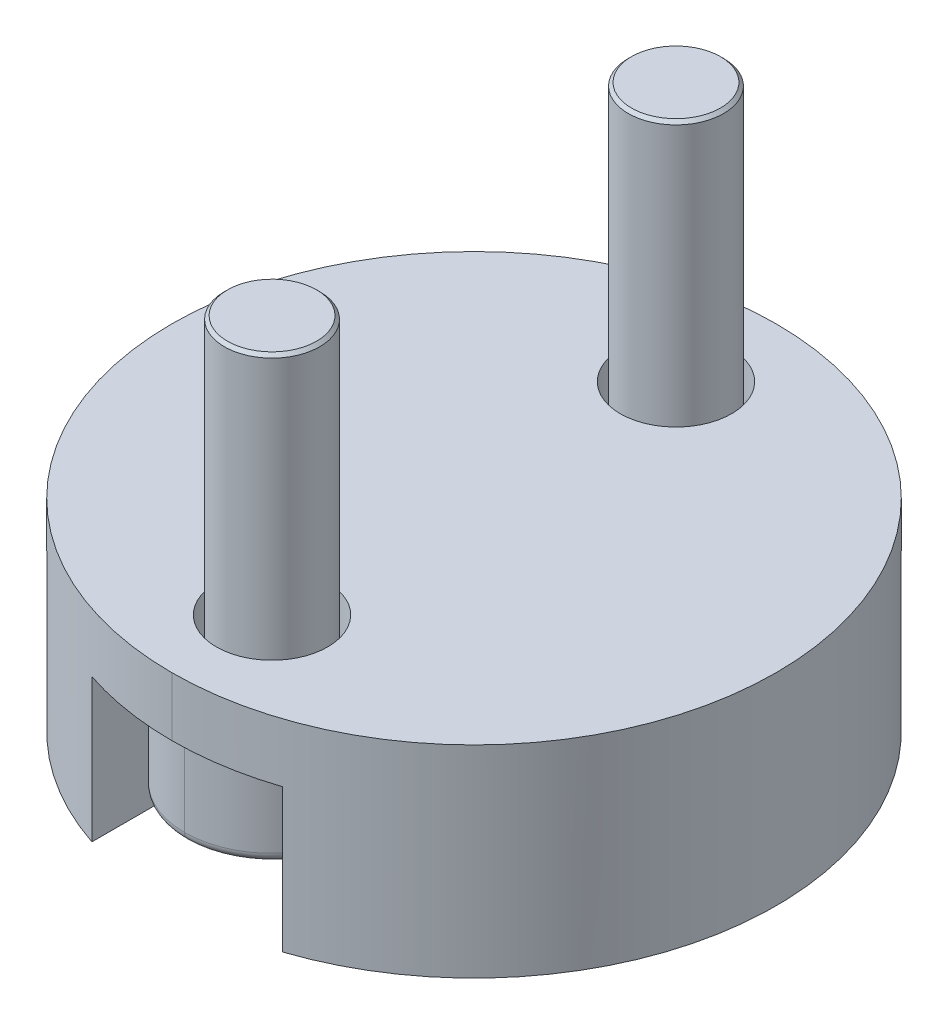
ISO-10303-21;
HEADER;
FILE_DESCRIPTION(('STEP AP214'),'2;1');
FILE_NAME('part.step','',(''),(''),'','','');
FILE_SCHEMA(('AUTOMOTIVE_DESIGN { 1 0 10303 214 1 1 1 1 }'));
ENDSEC;
DATA;
#1=APPLICATION_CONTEXT('core data for automotive mechanical design processes');
#2=APPLICATION_PROTOCOL_DEFINITION('international standard','automotive_design',2000,#1);
#3=PRODUCT_CONTEXT('',#1,'mechanical');
#4=PRODUCT('Part','Part','',(#3));
#5=PRODUCT_RELATED_PRODUCT_CATEGORY('part','',(#4));
#6=PRODUCT_DEFINITION_FORMATION('','',#4);
#7=PRODUCT_DEFINITION_CONTEXT('part definition',#1,'design');
#8=PRODUCT_DEFINITION('design','',#6,#7);
#9=PRODUCT_DEFINITION_SHAPE('','',#8);
#10=(LENGTH_UNIT() NAMED_UNIT(*) SI_UNIT(.MILLI.,.METRE.));
#11=(NAMED_UNIT(*) PLANE_ANGLE_UNIT() SI_UNIT($,.RADIAN.));
#12=(NAMED_UNIT(*) SI_UNIT($,.STERADIAN.) SOLID_ANGLE_UNIT());
#13=UNCERTAINTY_MEASURE_WITH_UNIT(LENGTH_MEASURE(1.E-05),#10,'distance_accuracy_value','');
#14=(GEOMETRIC_REPRESENTATION_CONTEXT(3) GLOBAL_UNCERTAINTY_ASSIGNED_CONTEXT((#13)) GLOBAL_UNIT_ASSIGNED_CONTEXT((#10,
#11,#12)) REPRESENTATION_CONTEXT('',''));
#15=CARTESIAN_POINT('',(0.,0.,0.));
#16=DIRECTION('',(0.,0.,1.));
#17=DIRECTION('',(1.,0.,0.));
#18=AXIS2_PLACEMENT_3D('',#15,#16,#17);
#19=CARTESIAN_POINT('',(-1.38994718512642E-12,4.50000000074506,6.35000000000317));
#20=DIRECTION('',(0.,-1.,0.));
#21=DIRECTION('',(0.,0.,-1.));
#22=AXIS2_PLACEMENT_3D('',#19,#20,#21);
#23=CYLINDRICAL_SURFACE('',#22,3.00000000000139);
#24=CARTESIAN_POINT('',(-1.38994718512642E-12,4.50000000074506,6.35000000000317));
#25=DIRECTION('',(0.,1.,0.));
#26=DIRECTION('',(0.,0.,1.));
#27=AXIS2_PLACEMENT_3D('',#24,#25,#26);
#28=CIRCLE('',#27,3.00000000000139);
#29=CARTESIAN_POINT('',(3.,4.50000000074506,6.35));
#30=VERTEX_POINT('',#29);
#31=CARTESIAN_POINT('',(-1.38994718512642E-12,4.50000000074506,3.35000000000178));
#32=VERTEX_POINT('',#31);
#33=EDGE_CURVE('E25',#30,#32,#28,.T.);
#34=ORIENTED_EDGE('',*,*,#33,.T.);
#35=DIRECTION('',(0.,-1.,0.));
#36=VECTOR('',#35,1.);
#37=CARTESIAN_POINT('',(-1.38994718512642E-12,4.50000000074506,3.35000000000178));
#38=LINE('',#37,#36);
#39=CARTESIAN_POINT('',(-8.36447591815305E-13,1.2928932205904,3.35000000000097));
#40=VERTEX_POINT('',#39);
#41=EDGE_CURVE('E604',#32,#40,#38,.T.);
#42=ORIENTED_EDGE('',*,*,#41,.T.);
#43=CARTESIAN_POINT('',(0.353553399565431,1.14644660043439,3.37090617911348));
#44=CARTESIAN_POINT('',(0.349907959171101,1.15009207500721,3.3704735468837));
#45=CARTESIAN_POINT('',(0.3462058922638,1.15368134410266,3.37004475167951));
#46=CARTESIAN_POINT('',(0.33874258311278,1.16069660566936,3.3692008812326));
#47=CARTESIAN_POINT('',(0.334982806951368,1.16412414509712,3.36878569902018));
#48=CARTESIAN_POINT('',(0.327411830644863,1.17081738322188,3.36796904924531));
#49=CARTESIAN_POINT('',(0.323602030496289,1.17408465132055,3.36756747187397));
#50=CARTESIAN_POINT('',(0.315938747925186,1.18045896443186,3.36677805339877));
#51=CARTESIAN_POINT('',(0.312086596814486,1.18356759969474,3.36639009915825));
#52=CARTESIAN_POINT('',(0.300557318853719,1.1925920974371,3.36525489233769));
#53=CARTESIAN_POINT('',(0.292750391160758,1.19834503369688,3.36451939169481));
#54=CARTESIAN_POINT('',(0.27704166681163,1.20923036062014,3.36310383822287));
#55=CARTESIAN_POINT('',(0.269148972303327,1.21437579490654,3.36242280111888));
#56=CARTESIAN_POINT('',(0.253319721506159,1.22406915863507,3.36111616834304));
#57=CARTESIAN_POINT('',(0.245391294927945,1.22863021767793,3.36048953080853));
#58=CARTESIAN_POINT('',(0.229538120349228,1.23718015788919,3.35929177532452));
#59=CARTESIAN_POINT('',(0.221620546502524,1.24118219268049,3.35871955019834));
#60=CARTESIAN_POINT('',(0.205832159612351,1.24864200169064,3.35763068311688));
#61=CARTESIAN_POINT('',(0.197967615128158,1.25211287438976,3.35711286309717));
#62=CARTESIAN_POINT('',(0.182324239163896,1.25854014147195,3.35613288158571));
#63=CARTESIAN_POINT('',(0.17455081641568,1.26150951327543,3.35566946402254));
#64=CARTESIAN_POINT('',(0.15912454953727,1.26696501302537,3.35479836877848));
#65=CARTESIAN_POINT('',(0.151476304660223,1.26946393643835,3.35438934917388));
#66=CARTESIAN_POINT('',(0.136331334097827,1.27401078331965,3.35362714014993));
#67=CARTESIAN_POINT('',(0.128838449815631,1.27607126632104,3.35327251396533));
#68=CARTESIAN_POINT('',(0.114031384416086,1.27977410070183,3.35261919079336));
#69=CARTESIAN_POINT('',(0.106720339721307,1.2814287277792,3.35231895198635));
#70=CARTESIAN_POINT('',(0.0923005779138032,1.28435299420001,3.35177451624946));
#71=CARTESIAN_POINT('',(0.085194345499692,1.28563458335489,3.35152866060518));
#72=CARTESIAN_POINT('',(0.0712044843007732,1.2878458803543,3.3510931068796));
#73=CARTESIAN_POINT('',(0.0643227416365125,1.28878717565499,3.35090162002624));
#74=CARTESIAN_POINT('',(0.0507990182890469,1.29035069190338,3.35057496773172));
#75=CARTESIAN_POINT('',(0.0441583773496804,1.29098410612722,3.35043786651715));
#76=CARTESIAN_POINT('',(0.0311311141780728,1.2919640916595,3.3502200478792));
#77=CARTESIAN_POINT('',(0.0247453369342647,1.2923214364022,3.35013723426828));
#78=CARTESIAN_POINT('',(0.0122394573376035,1.29278087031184,3.3500284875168));
#79=CARTESIAN_POINT('',(0.00611975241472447,1.29289328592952,3.35000025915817));
#80=CARTESIAN_POINT('',(-8.35884048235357E-13,1.2928932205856,3.35000000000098));
#81=B_SPLINE_CURVE_WITH_KNOTS('',3,(#43,#44,#45,#46,#47,#48,#49,#50,#51,#52,#53,#54,#55,#56,#57,
#58,#59,#60,#61,#62,#63,#64,#65,#66,#67,#68,#69,#70,#71,#72,#73,#74,#75,#76,#77,#78,#79,#80),
.UNSPECIFIED.,.F.,.F.,(4,2,2,2,2,2,2,2,2,2,2,2,2,2,2,2,2,2,4),(0.,0.0155200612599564,
0.0308313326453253,0.045933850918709,0.0608276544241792,0.0899862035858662,0.118310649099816,
0.145801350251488,0.172458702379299,0.198283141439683,0.223275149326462,0.247435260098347,
0.270764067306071,0.293262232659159,0.314930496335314,0.335769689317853,0.355780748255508,
0.374964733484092,0.393322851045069),.UNSPECIFIED.);
#82=CARTESIAN_POINT('',(0.353553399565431,1.14644660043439,3.37090617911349));
#83=VERTEX_POINT('',#82);
#84=EDGE_CURVE('E680',#83,#40,#81,.T.);
#85=ORIENTED_EDGE('',*,*,#84,.F.);
#86=CARTESIAN_POINT('',(1.50000004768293,-4.7683719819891E-08,3.7519238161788));
#87=CARTESIAN_POINT('',(1.14642288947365,0.353577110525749,3.54778594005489));
#88=CARTESIAN_POINT('',(0.758983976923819,0.741016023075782,3.41902193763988));
#89=CARTESIAN_POINT('',(0.353553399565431,1.14644660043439,3.37090617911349));
#90=(BOUNDED_CURVE() B_SPLINE_CURVE(3,(#86,#87,#88,#89),.UNSPECIFIED.,.F.,
.F.) B_SPLINE_CURVE_WITH_KNOTS((4,4),(1.04719753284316,1.45267067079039),
.UNSPECIFIED.) CURVE() GEOMETRIC_REPRESENTATION_ITEM() RATIONAL_B_SPLINE_CURVE((1.,
0.986346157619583,0.986346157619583,1.)) REPRESENTATION_ITEM(''));
#91=CARTESIAN_POINT('',(1.50000004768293,-4.7683719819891E-08,3.7519238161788));
#92=VERTEX_POINT('',#91);
#93=EDGE_CURVE('E600',#92,#83,#90,.T.);
#94=ORIENTED_EDGE('',*,*,#93,.F.);
#95=CARTESIAN_POINT('',(-1.38994718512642E-12,-4.7683719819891E-08,6.35000000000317));
#96=DIRECTION('',(0.,-1.,0.));
#97=DIRECTION('',(0.,0.,1.));
#98=AXIS2_PLACEMENT_3D('',#95,#96,#97);
#99=CIRCLE('',#98,3.00000000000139);
#100=CARTESIAN_POINT('',(3.,-4.76837180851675E-08,6.35));
#101=VERTEX_POINT('',#100);
#102=EDGE_CURVE('E565',#92,#101,#99,.T.);
#103=ORIENTED_EDGE('',*,*,#102,.T.);
#104=DIRECTION('',(0.,-1.,0.));
#105=VECTOR('',#104,1.);
#106=CARTESIAN_POINT('',(3.,4.50000000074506,6.35));
#107=LINE('',#106,#105);
#108=EDGE_CURVE('E538',#30,#101,#107,.T.);
#109=ORIENTED_EDGE('',*,*,#108,.F.);
#110=EDGE_LOOP('',(#34,#42,#85,#94,#103,#109));
#111=FACE_BOUND('',#110,.T.);
#112=ADVANCED_FACE('F16',(#111),#23,.F.);
#113=CARTESIAN_POINT('',(0.,-4.7683719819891E-08,0.));
#114=DIRECTION('',(0.,1.,0.));
#115=DIRECTION('',(0.,0.,1.));
#116=AXIS2_PLACEMENT_3D('',#113,#114,#115);
#117=CYLINDRICAL_SURFACE('',#116,9.5);
#118=CARTESIAN_POINT('',(0.,4.50000000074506,0.));
#119=DIRECTION('',(0.,1.,0.));
#120=DIRECTION('',(0.,0.,1.));
#121=AXIS2_PLACEMENT_3D('',#118,#119,#120);
#122=CIRCLE('',#121,9.5);
#123=CARTESIAN_POINT('',(3.,4.50000000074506,-9.01387818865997));
#124=VERTEX_POINT('',#123);
#125=CARTESIAN_POINT('',(0.,4.50000000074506,-9.5));
#126=VERTEX_POINT('',#125);
#127=EDGE_CURVE('E561',#124,#126,#122,.T.);
#128=ORIENTED_EDGE('',*,*,#127,.T.);
#129=DIRECTION('',(0.,1.,0.));
#130=VECTOR('',#129,1.);
#131=CARTESIAN_POINT('',(0.,-4.7683719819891E-08,-9.5));
#132=LINE('',#131,#130);
#133=CARTESIAN_POINT('',(0.,6.34999995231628,-9.5));
#134=VERTEX_POINT('',#133);
#135=EDGE_CURVE('E566',#126,#134,#132,.T.);
#136=ORIENTED_EDGE('',*,*,#135,.T.);
#137=CARTESIAN_POINT('',(0.,6.34999995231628,0.));
#138=DIRECTION('',(0.,-1.,0.));
#139=DIRECTION('',(0.,0.,1.));
#140=AXIS2_PLACEMENT_3D('',#137,#138,#139);
#141=CIRCLE('',#140,9.5);
#142=CARTESIAN_POINT('',(0.,6.34999995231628,9.5));
#143=VERTEX_POINT('',#142);
#144=EDGE_CURVE('E608',#134,#143,#141,.T.);
#145=ORIENTED_EDGE('',*,*,#144,.T.);
#146=DIRECTION('',(0.,1.,0.));
#147=VECTOR('',#146,1.);
#148=CARTESIAN_POINT('',(0.,-4.7683719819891E-08,9.5));
#149=LINE('',#148,#147);
#150=CARTESIAN_POINT('',(0.,4.50000000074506,9.5));
#151=VERTEX_POINT('',#150);
#152=EDGE_CURVE('E553',#151,#143,#149,.T.);
#153=ORIENTED_EDGE('',*,*,#152,.F.);
#154=CARTESIAN_POINT('',(0.,4.50000000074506,0.));
#155=DIRECTION('',(0.,1.,0.));
#156=DIRECTION('',(0.,0.,1.));
#157=AXIS2_PLACEMENT_3D('',#154,#155,#156);
#158=CIRCLE('',#157,9.5);
#159=CARTESIAN_POINT('',(3.,4.50000000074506,9.01387818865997));
#160=VERTEX_POINT('',#159);
#161=EDGE_CURVE('E609',#151,#160,#158,.T.);
#162=ORIENTED_EDGE('',*,*,#161,.T.);
#163=DIRECTION('',(0.,1.,0.));
#164=VECTOR('',#163,1.);
#165=CARTESIAN_POINT('',(3.,-4.7683719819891E-08,9.01387818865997));
#166=LINE('',#165,#164);
#167=CARTESIAN_POINT('',(3.,-4.7683719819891E-08,9.01387818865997));
#168=VERTEX_POINT('',#167);
#169=EDGE_CURVE('E548',#168,#160,#166,.T.);
#170=ORIENTED_EDGE('',*,*,#169,.F.);
#171=CARTESIAN_POINT('',(0.,-4.7683719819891E-08,0.));
#172=DIRECTION('',(0.,-1.,0.));
#173=DIRECTION('',(0.,0.,1.));
#174=AXIS2_PLACEMENT_3D('',#171,#172,#173);
#175=CIRCLE('',#174,9.5);
#176=CARTESIAN_POINT('',(3.,-4.7683719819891E-08,-9.01387818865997));
#177=VERTEX_POINT('',#176);
#178=EDGE_CURVE('E616',#177,#168,#175,.T.);
#179=ORIENTED_EDGE('',*,*,#178,.F.);
#180=DIRECTION('',(0.,-1.,0.));
#181=VECTOR('',#180,1.);
#182=CARTESIAN_POINT('',(3.,-4.7683719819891E-08,-9.01387818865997));
#183=LINE('',#182,#181);
#184=EDGE_CURVE('E588',#124,#177,#183,.T.);
#185=ORIENTED_EDGE('',*,*,#184,.F.);
#186=EDGE_LOOP('',(#128,#136,#145,#153,#162,#170,#179,#185));
#187=FACE_BOUND('',#186,.T.);
#188=ADVANCED_FACE('F1853',(#187),#117,.T.);
#189=CARTESIAN_POINT('',(0.,-4.7683719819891E-08,0.));
#190=DIRECTION('',(0.,1.,0.));
#191=DIRECTION('',(0.,0.,1.));
#192=AXIS2_PLACEMENT_3D('',#189,#190,#191);
#193=CYLINDRICAL_SURFACE('',#192,9.5);
#194=ORIENTED_EDGE('',*,*,#135,.F.);
#195=CARTESIAN_POINT('',(0.,4.50000000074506,0.));
#196=DIRECTION('',(0.,1.,0.));
#197=DIRECTION('',(0.,0.,1.));
#198=AXIS2_PLACEMENT_3D('',#195,#196,#197);
#199=CIRCLE('',#198,9.5);
#200=CARTESIAN_POINT('',(-3.,4.50000000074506,-9.01387818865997));
#201=VERTEX_POINT('',#200);
#202=EDGE_CURVE('E613',#126,#201,#199,.T.);
#203=ORIENTED_EDGE('',*,*,#202,.T.);
#204=DIRECTION('',(0.,1.,0.));
#205=VECTOR('',#204,1.);
#206=CARTESIAN_POINT('',(-3.,-4.7683719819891E-08,-9.01387818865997));
#207=LINE('',#206,#205);
#208=CARTESIAN_POINT('',(-3.,-4.7683719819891E-08,-9.01387818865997));
#209=VERTEX_POINT('',#208);
#210=EDGE_CURVE('E636',#209,#201,#207,.T.);
#211=ORIENTED_EDGE('',*,*,#210,.F.);
#212=CARTESIAN_POINT('',(0.,-4.7683719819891E-08,0.));
#213=DIRECTION('',(0.,-1.,0.));
#214=DIRECTION('',(0.,0.,1.));
#215=AXIS2_PLACEMENT_3D('',#212,#213,#214);
#216=CIRCLE('',#215,9.5);
#217=CARTESIAN_POINT('',(-3.,-4.7683719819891E-08,9.01387818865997));
#218=VERTEX_POINT('',#217);
#219=EDGE_CURVE('E620',#218,#209,#216,.T.);
#220=ORIENTED_EDGE('',*,*,#219,.F.);
#221=DIRECTION('',(0.,-1.,0.));
#222=VECTOR('',#221,1.);
#223=CARTESIAN_POINT('',(-3.,-4.7683719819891E-08,9.01387818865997));
#224=LINE('',#223,#222);
#225=CARTESIAN_POINT('',(-3.,4.50000000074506,9.01387818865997));
#226=VERTEX_POINT('',#225);
#227=EDGE_CURVE('E581',#226,#218,#224,.T.);
#228=ORIENTED_EDGE('',*,*,#227,.F.);
#229=CARTESIAN_POINT('',(0.,4.50000000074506,0.));
#230=DIRECTION('',(0.,1.,0.));
#231=DIRECTION('',(0.,0.,1.));
#232=AXIS2_PLACEMENT_3D('',#229,#230,#231);
#233=CIRCLE('',#232,9.5);
#234=EDGE_CURVE('E630',#226,#151,#233,.T.);
#235=ORIENTED_EDGE('',*,*,#234,.T.);
#236=ORIENTED_EDGE('',*,*,#152,.T.);
#237=CARTESIAN_POINT('',(0.,6.34999995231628,0.));
#238=DIRECTION('',(0.,-1.,0.));
#239=DIRECTION('',(0.,0.,1.));
#240=AXIS2_PLACEMENT_3D('',#237,#238,#239);
#241=CIRCLE('',#240,9.5);
#242=EDGE_CURVE('E549',#143,#134,#241,.T.);
#243=ORIENTED_EDGE('',*,*,#242,.T.);
#244=EDGE_LOOP('',(#194,#203,#211,#220,#228,#235,#236,#243));
#245=FACE_BOUND('',#244,.T.);
#246=ADVANCED_FACE('F697',(#245),#193,.T.);
#247=CARTESIAN_POINT('',(0.,0.792893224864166,-6.35));
#248=DIRECTION('',(0.,0.,1.));
#249=DIRECTION('',(1.,0.,0.));
#250=AXIS2_PLACEMENT_3D('',#247,#248,#249);
#251=CYLINDRICAL_SURFACE('',#250,0.499999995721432);
#252=DIRECTION('',(0.,0.,1.));
#253=VECTOR('',#252,1.);
#254=CARTESIAN_POINT('',(0.353553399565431,1.14644660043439,-6.35));
#255=LINE('',#254,#253);
#256=CARTESIAN_POINT('',(0.353553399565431,1.14644660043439,-3.37090617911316));
#257=VERTEX_POINT('',#256);
#258=EDGE_CURVE('E554',#257,#83,#255,.T.);
#259=ORIENTED_EDGE('',*,*,#258,.T.);
#260=ORIENTED_EDGE('',*,*,#84,.T.);
#261=CARTESIAN_POINT('',(-8.35884048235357E-13,1.2928932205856,3.35000000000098));
#262=CARTESIAN_POINT('',(-0.00611975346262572,1.29289328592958,3.3500002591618));
#263=CARTESIAN_POINT('',(-0.0122394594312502,1.2927808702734,3.35002848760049));
#264=CARTESIAN_POINT('',(-0.0247453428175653,1.29232143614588,3.35013723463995));
#265=CARTESIAN_POINT('',(-0.0311311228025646,1.29196409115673,3.35022004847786));
#266=CARTESIAN_POINT('',(-0.0441583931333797,1.29098410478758,3.35043786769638));
#267=CARTESIAN_POINT('',(-0.0507990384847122,1.29035068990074,3.35057496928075));
#268=CARTESIAN_POINT('',(-0.0643227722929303,1.28878717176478,3.35090162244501));
#269=CARTESIAN_POINT('',(-0.0712045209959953,1.28784587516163,3.35109310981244));
#270=CARTESIAN_POINT('',(-0.0851943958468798,1.28563457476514,3.35152866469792));
#271=CARTESIAN_POINT('',(-0.0923006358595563,1.2843529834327,3.35177452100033));
#272=CARTESIAN_POINT('',(-0.106720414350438,1.28142871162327,3.352318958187));
#273=CARTESIAN_POINT('',(-0.114031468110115,1.27977408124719,3.35261919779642));
#274=CARTESIAN_POINT('',(-0.128838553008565,1.27607123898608,3.35327252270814));
#275=CARTESIAN_POINT('',(-0.136331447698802,1.27401075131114,3.35362714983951));
#276=CARTESIAN_POINT('',(-0.151476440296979,1.26946389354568,3.35438936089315));
#277=CARTESIAN_POINT('',(-0.159124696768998,1.26696496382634,3.35479838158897));
#278=CARTESIAN_POINT('',(-0.174550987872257,1.26150944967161,3.35566947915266));
#279=CARTESIAN_POINT('',(-0.182324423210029,1.2585400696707,3.35613289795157));
#280=CARTESIAN_POINT('',(-0.19796782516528,1.25211278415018,3.35711288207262));
#281=CARTESIAN_POINT('',(-0.205832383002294,1.24864190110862,3.35763070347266));
#282=CARTESIAN_POINT('',(-0.22162079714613,1.24118206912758,3.35871957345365));
#283=CARTESIAN_POINT('',(-0.229538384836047,1.23718002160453,3.35929180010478));
#284=CARTESIAN_POINT('',(-0.245391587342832,1.22863005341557,3.36048955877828));
#285=CARTESIAN_POINT('',(-0.253320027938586,1.22406897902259,3.36111619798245));
#286=CARTESIAN_POINT('',(-0.269149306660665,1.21437558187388,3.36242283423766));
#287=CARTESIAN_POINT('',(-0.277042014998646,1.20923012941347,3.36310387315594));
#288=CARTESIAN_POINT('',(-0.292750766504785,1.19834476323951,3.36451943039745));
#289=CARTESIAN_POINT('',(-0.300557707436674,1.19259180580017,3.36525493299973));
#290=CARTESIAN_POINT('',(-0.312087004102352,1.18356727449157,3.36639014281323));
#291=CARTESIAN_POINT('',(-0.315939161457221,1.18045862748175,3.36677809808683));
#292=CARTESIAN_POINT('',(-0.323602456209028,1.17408429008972,3.36756751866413));
#293=CARTESIAN_POINT('',(-0.327412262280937,1.17081700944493,3.36796909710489));
#294=CARTESIAN_POINT('',(-0.334983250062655,1.16412374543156,3.36878574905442));
#295=CARTESIAN_POINT('',(-0.338743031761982,1.16069619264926,3.36920093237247));
#296=CARTESIAN_POINT('',(-0.346206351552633,1.15368090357,3.37004480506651));
#297=CARTESIAN_POINT('',(-0.349908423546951,1.15009162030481,3.37047360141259));
#298=CARTESIAN_POINT('',(-0.353553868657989,1.14644613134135,3.37090623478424));
#299=B_SPLINE_CURVE_WITH_KNOTS('',3,(#261,#262,#263,#264,#265,#266,#267,#268,#269,#270,#271,
#272,#273,#274,#275,#276,#277,#278,#279,#280,#281,#282,#283,#284,#285,#286,#287,#288,#289,#290,
#291,#292,#293,#294,#295,#296,#297,#298),.UNSPECIFIED.,.F.,.F.,(4,2,2,2,2,2,2,2,2,2,2,2,2,2,2,2,
2,2,4),(0.,0.0183581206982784,0.0375421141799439,0.0575531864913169,0.0783923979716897,
0.100060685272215,0.122558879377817,0.145887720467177,0.170047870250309,0.195039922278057,
0.220864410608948,0.247521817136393,0.275012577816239,0.303337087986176,0.332495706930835,
0.347389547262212,0.362492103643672,0.377803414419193,0.393323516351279),.UNSPECIFIED.);
#300=CARTESIAN_POINT('',(-0.353553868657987,1.14644613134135,3.37090623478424));
#301=VERTEX_POINT('',#300);
#302=EDGE_CURVE('E720',#40,#301,#299,.T.);
#303=ORIENTED_EDGE('',*,*,#302,.T.);
#304=DIRECTION('',(0.,0.,1.));
#305=VECTOR('',#304,1.);
#306=CARTESIAN_POINT('',(-0.353553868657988,1.14644613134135,-6.35));
#307=LINE('',#306,#305);
#308=CARTESIAN_POINT('',(-0.353553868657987,1.14644613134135,-3.37090623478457));
#309=VERTEX_POINT('',#308);
#310=EDGE_CURVE('E621',#309,#301,#307,.T.);
#311=ORIENTED_EDGE('',*,*,#310,.F.);
#312=CARTESIAN_POINT('',(-0.353553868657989,1.14644613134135,-3.37090623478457));
#313=CARTESIAN_POINT('',(-0.349910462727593,1.15008958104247,-3.37047384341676));
#314=CARTESIAN_POINT('',(-0.346210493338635,1.1536768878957,-3.37004528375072));
#315=CARTESIAN_POINT('',(-0.338751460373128,1.16068839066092,-3.36920186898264));
#316=CARTESIAN_POINT('',(-0.334993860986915,1.164114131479,-3.36878690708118));
#317=CARTESIAN_POINT('',(-0.32742730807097,1.17080393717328,-3.36797068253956));
#318=CARTESIAN_POINT('',(-0.323619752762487,1.17406956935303,-3.36756931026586));
#319=CARTESIAN_POINT('',(-0.315961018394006,1.18044077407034,-3.3667802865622));
#320=CARTESIAN_POINT('',(-0.312111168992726,1.18354793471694,-3.36639252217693));
#321=CARTESIAN_POINT('',(-0.300588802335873,1.19256829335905,-3.36525785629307));
#322=CARTESIAN_POINT('',(-0.292786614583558,1.19831875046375,-3.36452269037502));
#323=CARTESIAN_POINT('',(-0.277087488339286,1.20919975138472,-3.36310774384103));
#324=CARTESIAN_POINT('',(-0.26919964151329,1.21434332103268,-3.36242698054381));
#325=CARTESIAN_POINT('',(-0.253380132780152,1.22403355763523,-3.36112083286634));
#326=CARTESIAN_POINT('',(-0.245456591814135,1.22859333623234,-3.36049440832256));
#327=CARTESIAN_POINT('',(-0.229613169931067,1.2371412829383,-3.35929701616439));
#328=CARTESIAN_POINT('',(-0.221700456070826,1.24114258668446,-3.35872494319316));
#329=CARTESIAN_POINT('',(-0.205921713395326,1.24860146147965,-3.3576363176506));
#330=CARTESIAN_POINT('',(-0.198061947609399,1.25207211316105,-3.35711858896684));
#331=CARTESIAN_POINT('',(-0.182428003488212,1.25849942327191,-3.35613872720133));
#332=CARTESIAN_POINT('',(-0.174659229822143,1.261469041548,-3.35567534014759));
#333=CARTESIAN_POINT('',(-0.159242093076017,1.26692547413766,-3.35480424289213));
#334=CARTESIAN_POINT('',(-0.151598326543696,1.26942506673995,-3.35439519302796));
#335=CARTESIAN_POINT('',(-0.136462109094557,1.27397364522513,-3.35363286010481));
#336=CARTESIAN_POINT('',(-0.128973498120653,1.27603517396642,-3.35327814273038));
#337=CARTESIAN_POINT('',(-0.114174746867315,1.27974044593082,-3.35262457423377));
#338=CARTESIAN_POINT('',(-0.106867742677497,1.2813964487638,-3.35232418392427));
#339=CARTESIAN_POINT('',(-0.0924558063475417,1.28432376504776,-3.3517793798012));
#340=CARTESIAN_POINT('',(-0.0853533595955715,1.28560701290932,-3.35153331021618));
#341=CARTESIAN_POINT('',(-0.0713707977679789,1.28782188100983,-3.35109727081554));
#342=CARTESIAN_POINT('',(-0.0644925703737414,1.28876507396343,-3.3509055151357));
#343=CARTESIAN_POINT('',(-0.0509755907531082,1.29033258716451,-3.35057823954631));
#344=CARTESIAN_POINT('',(-0.0443381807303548,1.29096808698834,-3.35044078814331));
#345=CARTESIAN_POINT('',(-0.0313170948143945,1.29195242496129,-3.35022228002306));
#346=CARTESIAN_POINT('',(-0.0249342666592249,1.29231202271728,-3.35013912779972));
#347=CARTESIAN_POINT('',(-0.0124339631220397,1.29277602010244,-3.35002937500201));
#348=CARTESIAN_POINT('',(-0.00631688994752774,1.29289073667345,-3.35000049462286));
#349=CARTESIAN_POINT('',(0.00592256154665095,1.29289562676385,-3.34999951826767));
#350=CARTESIAN_POINT('',(0.012044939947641,1.29278560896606,-3.3500274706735));
#351=CARTESIAN_POINT('',(0.0245564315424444,1.2923308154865,-3.35013550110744));
#352=CARTESIAN_POINT('',(0.0309451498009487,1.29197569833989,-3.35021786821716));
#353=CARTESIAN_POINT('',(0.0439785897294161,1.29100004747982,-3.35043491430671));
#354=CARTESIAN_POINT('',(0.0506224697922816,1.29036872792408,-3.35057169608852));
#355=CARTESIAN_POINT('',(0.0641529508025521,1.28880921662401,-3.35089774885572));
#356=CARTESIAN_POINT('',(0.0710382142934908,1.28786981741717,-3.3510889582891));
#357=CARTESIAN_POINT('',(0.0850353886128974,1.28566209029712,-3.35152402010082));
#358=CARTESIAN_POINT('',(0.0921454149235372,1.2843821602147,-3.35176966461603));
#359=CARTESIAN_POINT('',(0.106573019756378,1.28146094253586,-3.35231373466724));
#360=CARTESIAN_POINT('',(0.113888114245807,1.27980768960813,-3.35261382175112));
#361=CARTESIAN_POINT('',(0.128703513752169,1.27610728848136,-3.35326690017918));
#362=CARTESIAN_POINT('',(0.13620068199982,1.27404784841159,-3.35362143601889));
#363=CARTESIAN_POINT('',(0.151354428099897,1.26950272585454,-3.3543835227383));
#364=CARTESIAN_POINT('',(0.159007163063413,1.26700446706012,-3.3547925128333));
#365=CARTESIAN_POINT('',(0.174442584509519,1.26154988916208,-3.35566360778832));
#366=CARTESIAN_POINT('',(0.182220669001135,1.25858075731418,-3.35612705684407));
#367=CARTESIAN_POINT('',(0.19787350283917,1.25215351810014,-3.35710716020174));
#368=CARTESIAN_POINT('',(0.205742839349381,1.24868241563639,-3.35762507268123));
#369=CARTESIAN_POINT('',(0.221540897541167,1.24122165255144,-3.35871418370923));
#370=CARTESIAN_POINT('',(0.22946334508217,1.23721887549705,-3.35928656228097));
#371=CARTESIAN_POINT('',(0.245326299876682,1.22866691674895,-3.36048468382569));
#372=CARTESIAN_POINT('',(0.253259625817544,1.22410456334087,-3.3611115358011));
#373=CARTESIAN_POINT('',(0.269098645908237,1.2144080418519,-3.36241865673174));
#374=CARTESIAN_POINT('',(0.276996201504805,1.20926072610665,-3.36309996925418));
#375=CARTESIAN_POINT('',(0.292714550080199,1.19837103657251,-3.364516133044));
#376=CARTESIAN_POINT('',(0.300526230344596,1.19261560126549,-3.36525197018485));
#377=CARTESIAN_POINT('',(0.312062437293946,1.18358693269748,-3.36638772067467));
#378=CARTESIAN_POINT('',(0.315916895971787,1.18047681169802,-3.3667758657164));
#379=CARTESIAN_POINT('',(0.32358473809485,1.17409936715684,-3.36756568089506));
#380=CARTESIAN_POINT('',(0.327396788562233,1.1708304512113,-3.36796746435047));
#381=CARTESIAN_POINT('',(0.334972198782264,1.16413375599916,-3.36878454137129));
#382=CARTESIAN_POINT('',(0.338734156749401,1.16070440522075,-3.36919994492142));
#383=CARTESIAN_POINT('',(0.346201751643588,1.15368535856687,-3.37004427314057));
#384=CARTESIAN_POINT('',(0.349905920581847,1.15009411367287,-3.37047330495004));
#385=CARTESIAN_POINT('',(0.353553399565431,1.14644660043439,-3.37090617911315));
#386=B_SPLINE_CURVE_WITH_KNOTS('',3,(#312,#313,#314,#315,#316,#317,#318,#319,#320,#321,#322,
#323,#324,#325,#326,#327,#328,#329,#330,#331,#332,#333,#334,#335,#336,#337,#338,#339,#340,#341,
#342,#343,#344,#345,#346,#347,#348,#349,#350,#351,#352,#353,#354,#355,#356,#357,#358,#359,#360,
#361,#362,#363,#364,#365,#366,#367,#368,#369,#370,#371,#372,#373,#374,#375,#376,#377,#378,#379,
#380,#381,#382,#383,#384,#385),.UNSPECIFIED.,.F.,.F.,(4,2,2,2,2,2,2,2,2,2,2,2,2,2,2,2,2,2,2,2,2,
2,2,2,2,2,2,2,2,2,2,2,2,2,2,2,4),(0.,0.0155114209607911,0.030814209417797,0.0459084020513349,
0.0607940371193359,0.0899367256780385,0.118245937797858,0.145722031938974,0.172365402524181,
0.198176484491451,0.223155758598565,0.247303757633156,0.270621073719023,0.293108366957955,
0.314766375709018,0.335595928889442,0.355597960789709,0.374773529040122,0.393123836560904,
0.411489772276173,0.430682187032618,0.450702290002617,0.471551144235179,0.493229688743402,
0.515738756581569,0.5390790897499,0.563251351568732,0.588256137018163,0.614093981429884,
0.640765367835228,0.668270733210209,0.696610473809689,0.725784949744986,0.74068695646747,
0.755797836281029,0.771117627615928,0.786646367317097),.UNSPECIFIED.);
#387=EDGE_CURVE('E652',#309,#257,#386,.T.);
#388=ORIENTED_EDGE('',*,*,#387,.T.);
#389=EDGE_LOOP('',(#259,#260,#303,#311,#388));
#390=FACE_BOUND('',#389,.T.);
#391=ADVANCED_FACE('F687',(#390),#251,.F.);
#392=CARTESIAN_POINT('',(0.,-4.7683719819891E-08,0.));
#393=DIRECTION('',(0.,1.,0.));
#394=DIRECTION('',(1.,0.,0.));
#395=AXIS2_PLACEMENT_3D('',#392,#393,#394);
#396=PLANE('',#395);
#397=DIRECTION('',(0.,0.,-1.));
#398=VECTOR('',#397,1.);
#399=CARTESIAN_POINT('',(-3.,-4.7683719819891E-08,0.));
#400=LINE('',#399,#398);
#401=CARTESIAN_POINT('',(-3.,-4.76837180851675E-08,6.35000407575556));
#402=VERTEX_POINT('',#401);
#403=EDGE_CURVE('E547',#218,#402,#400,.T.);
#404=ORIENTED_EDGE('',*,*,#403,.F.);
#405=ORIENTED_EDGE('',*,*,#219,.T.);
#406=DIRECTION('',(0.,0.,-1.));
#407=VECTOR('',#406,1.);
#408=CARTESIAN_POINT('',(-3.,-4.7683719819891E-08,0.));
#409=LINE('',#408,#407);
#410=CARTESIAN_POINT('',(-3.,-4.76837180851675E-08,-6.35));
#411=VERTEX_POINT('',#410);
#412=EDGE_CURVE('E592',#411,#209,#409,.T.);
#413=ORIENTED_EDGE('',*,*,#412,.F.);
#414=CARTESIAN_POINT('',(1.38474301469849E-12,-4.7683719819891E-08,-6.35000000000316));
#415=DIRECTION('',(0.,-1.,0.));
#416=DIRECTION('',(0.,0.,1.));
#417=AXIS2_PLACEMENT_3D('',#414,#415,#416);
#418=CIRCLE('',#417,3.00000000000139);
#419=CARTESIAN_POINT('',(-1.50000004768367,-4.7683719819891E-08,-3.75192381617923));
#420=VERTEX_POINT('',#419);
#421=EDGE_CURVE('E559',#420,#411,#418,.T.);
#422=ORIENTED_EDGE('',*,*,#421,.F.);
#423=DIRECTION('',(0.,0.,-1.));
#424=VECTOR('',#423,1.);
#425=CARTESIAN_POINT('',(-1.50000004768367,-4.7683719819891E-08,0.));
#426=LINE('',#425,#424);
#427=CARTESIAN_POINT('',(-1.50000004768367,-4.7683719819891E-08,3.75192381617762));
#428=VERTEX_POINT('',#427);
#429=EDGE_CURVE('E572',#428,#420,#426,.T.);
#430=ORIENTED_EDGE('',*,*,#429,.F.);
#431=CARTESIAN_POINT('',(-1.38994718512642E-12,-4.7683719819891E-08,6.35000000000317));
#432=DIRECTION('',(0.,-1.,0.));
#433=DIRECTION('',(0.,0.,1.));
#434=AXIS2_PLACEMENT_3D('',#431,#432,#433);
#435=CIRCLE('',#434,3.00000000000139);
#436=EDGE_CURVE('E537',#402,#428,#435,.T.);
#437=ORIENTED_EDGE('',*,*,#436,.F.);
#438=EDGE_LOOP('',(#404,#405,#413,#422,#430,#437));
#439=FACE_BOUND('',#438,.T.);
#440=ADVANCED_FACE('F18',(#439),#396,.F.);
#441=CARTESIAN_POINT('',(0.,-4.7683719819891E-08,0.));
#442=DIRECTION('',(0.,1.,0.));
#443=DIRECTION('',(1.,0.,0.));
#444=AXIS2_PLACEMENT_3D('',#441,#442,#443);
#445=PLANE('',#444);
#446=DIRECTION('',(0.,0.,1.));
#447=VECTOR('',#446,1.);
#448=CARTESIAN_POINT('',(3.,-4.7683719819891E-08,0.));
#449=LINE('',#448,#447);
#450=EDGE_CURVE('E542',#101,#168,#449,.T.);
#451=ORIENTED_EDGE('',*,*,#450,.F.);
#452=ORIENTED_EDGE('',*,*,#102,.F.);
#453=DIRECTION('',(0.,0.,1.));
#454=VECTOR('',#453,1.);
#455=CARTESIAN_POINT('',(1.50000004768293,-4.7683719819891E-08,0.));
#456=LINE('',#455,#454);
#457=CARTESIAN_POINT('',(1.50000004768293,-4.7683719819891E-08,-3.7519238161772));
#458=VERTEX_POINT('',#457);
#459=EDGE_CURVE('E596',#458,#92,#456,.T.);
#460=ORIENTED_EDGE('',*,*,#459,.F.);
#461=CARTESIAN_POINT('',(1.38474301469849E-12,-4.7683719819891E-08,-6.35000000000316));
#462=DIRECTION('',(0.,-1.,0.));
#463=DIRECTION('',(0.,0.,1.));
#464=AXIS2_PLACEMENT_3D('',#461,#462,#463);
#465=CIRCLE('',#464,3.00000000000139);
#466=CARTESIAN_POINT('',(3.,-4.76837180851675E-08,-6.35000407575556));
#467=VERTEX_POINT('',#466);
#468=EDGE_CURVE('E587',#467,#458,#465,.T.);
#469=ORIENTED_EDGE('',*,*,#468,.F.);
#470=DIRECTION('',(0.,0.,1.));
#471=VECTOR('',#470,1.);
#472=CARTESIAN_POINT('',(3.,-4.7683719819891E-08,0.));
#473=LINE('',#472,#471);
#474=EDGE_CURVE('E631',#177,#467,#473,.T.);
#475=ORIENTED_EDGE('',*,*,#474,.F.);
#476=ORIENTED_EDGE('',*,*,#178,.T.);
#477=EDGE_LOOP('',(#451,#452,#460,#469,#475,#476));
#478=FACE_BOUND('',#477,.T.);
#479=ADVANCED_FACE('F840',(#478),#445,.F.);
#480=CARTESIAN_POINT('',(0.,6.34999995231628,0.));
#481=DIRECTION('',(0.,1.,0.));
#482=DIRECTION('',(1.,0.,0.));
#483=AXIS2_PLACEMENT_3D('',#480,#481,#482);
#484=PLANE('',#483);
#485=ORIENTED_EDGE('',*,*,#242,.F.);
#486=ORIENTED_EDGE('',*,*,#144,.F.);
#487=EDGE_LOOP('',(#485,#486));
#488=FACE_BOUND('',#487,.T.);
#489=CARTESIAN_POINT('',(0.,6.34999995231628,-6.35));
#490=DIRECTION('',(0.,1.,0.));
#491=DIRECTION('',(0.,0.,1.));
#492=AXIS2_PLACEMENT_3D('',#489,#490,#491);
#493=CIRCLE('',#492,1.75);
#494=CARTESIAN_POINT('',(0.,6.34999995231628,-4.6));
#495=VERTEX_POINT('',#494);
#496=EDGE_CURVE('E533',#495,#495,#493,.T.);
#497=ORIENTED_EDGE('',*,*,#496,.F.);
#498=EDGE_LOOP('',(#497));
#499=FACE_BOUND('',#498,.T.);
#500=CARTESIAN_POINT('',(0.,6.34999995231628,6.35));
#501=DIRECTION('',(0.,1.,0.));
#502=DIRECTION('',(0.,0.,1.));
#503=AXIS2_PLACEMENT_3D('',#500,#501,#502);
#504=CIRCLE('',#503,1.75);
#505=CARTESIAN_POINT('',(0.,6.34999995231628,8.1));
#506=VERTEX_POINT('',#505);
#507=EDGE_CURVE('E998',#506,#506,#504,.T.);
#508=ORIENTED_EDGE('',*,*,#507,.F.);
#509=EDGE_LOOP('',(#508));
#510=FACE_BOUND('',#509,.T.);
#511=ADVANCED_FACE('F1695',(#488,#499,#510),#484,.T.);
#512=CARTESIAN_POINT('',(-1.6,-0.1,-6.35));
#513=DIRECTION('',(0.707106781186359,-0.707106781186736,0.));
#514=DIRECTION('',(0.,0.,-1.));
#515=AXIS2_PLACEMENT_3D('',#512,#513,#514);
#516=PLANE('',#515);
#517=ORIENTED_EDGE('',*,*,#310,.T.);
#518=CARTESIAN_POINT('',(-0.353553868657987,1.14644613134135,3.37090623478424));
#519=CARTESIAN_POINT('',(-0.758984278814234,0.741015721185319,3.41902203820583));
#520=CARTESIAN_POINT('',(-1.14642302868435,0.353576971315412,3.547786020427));
#521=CARTESIAN_POINT('',(-1.50000004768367,-4.7683719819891E-08,3.75192381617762));
#522=(BOUNDED_CURVE() B_SPLINE_CURVE(3,(#518,#519,#520,#521),.UNSPECIFIED.,.F.,
.F.) B_SPLINE_CURVE_WITH_KNOTS((4,4),(4.83051479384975,5.23598777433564),
.UNSPECIFIED.) CURVE() GEOMETRIC_REPRESENTATION_ITEM() RATIONAL_B_SPLINE_CURVE((1.,
0.986346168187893,0.986346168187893,1.)) REPRESENTATION_ITEM(''));
#523=EDGE_CURVE('E576',#301,#428,#522,.T.);
#524=ORIENTED_EDGE('',*,*,#523,.T.);
#525=ORIENTED_EDGE('',*,*,#429,.T.);
#526=CARTESIAN_POINT('',(-1.50000004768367,-4.7683719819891E-08,-3.75192381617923));
#527=CARTESIAN_POINT('',(-1.14642302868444,0.353576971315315,-3.54778602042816));
#528=CARTESIAN_POINT('',(-0.758984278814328,0.741015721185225,-3.41902203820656));
#529=CARTESIAN_POINT('',(-0.353553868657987,1.14644613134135,-3.37090623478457));
#530=(BOUNDED_CURVE() B_SPLINE_CURVE(3,(#526,#527,#528,#529),.UNSPECIFIED.,.F.,
.F.) B_SPLINE_CURVE_WITH_KNOTS((4,4),(1.04719753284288,1.4526705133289),
.UNSPECIFIED.) CURVE() GEOMETRIC_REPRESENTATION_ITEM() RATIONAL_B_SPLINE_CURVE((1.,
0.986346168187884,0.986346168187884,1.)) REPRESENTATION_ITEM(''));
#531=EDGE_CURVE('E577',#420,#309,#530,.T.);
#532=ORIENTED_EDGE('',*,*,#531,.T.);
#533=EDGE_LOOP('',(#517,#524,#525,#532));
#534=FACE_BOUND('',#533,.T.);
#535=ADVANCED_FACE('F700',(#534),#516,.T.);
#536=CARTESIAN_POINT('',(0.353553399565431,1.14644660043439,-6.35));
#537=DIRECTION('',(-0.707106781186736,-0.707106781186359,0.));
#538=DIRECTION('',(-0.707106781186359,0.707106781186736,0.));
#539=AXIS2_PLACEMENT_3D('',#536,#537,#538);
#540=PLANE('',#539);
#541=ORIENTED_EDGE('',*,*,#459,.T.);
#542=ORIENTED_EDGE('',*,*,#93,.T.);
#543=ORIENTED_EDGE('',*,*,#258,.F.);
#544=CARTESIAN_POINT('',(0.353553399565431,1.14644660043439,-3.37090617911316));
#545=CARTESIAN_POINT('',(0.758983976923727,0.741016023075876,-3.41902193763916));
#546=CARTESIAN_POINT('',(1.14642288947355,0.353577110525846,-3.54778594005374));
#547=CARTESIAN_POINT('',(1.50000004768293,-4.7683719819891E-08,-3.7519238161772));
#548=(BOUNDED_CURVE() B_SPLINE_CURVE(3,(#544,#545,#546,#547),.UNSPECIFIED.,.F.,
.F.) B_SPLINE_CURVE_WITH_KNOTS((4,4),(4.83051463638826,5.23598777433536),
.UNSPECIFIED.) CURVE() GEOMETRIC_REPRESENTATION_ITEM() RATIONAL_B_SPLINE_CURVE((1.,
0.986346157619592,0.986346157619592,1.)) REPRESENTATION_ITEM(''));
#549=EDGE_CURVE('E635',#257,#458,#548,.T.);
#550=ORIENTED_EDGE('',*,*,#549,.T.);
#551=EDGE_LOOP('',(#541,#542,#543,#550));
#552=FACE_BOUND('',#551,.T.);
#553=ADVANCED_FACE('F834',(#552),#540,.T.);
#554=CARTESIAN_POINT('',(3.,4.50000000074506,-6.35000407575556));
#555=DIRECTION('',(-1.,0.,0.));
#556=DIRECTION('',(0.,0.,1.));
#557=AXIS2_PLACEMENT_3D('',#554,#555,#556);
#558=PLANE('',#557);
#559=ORIENTED_EDGE('',*,*,#474,.T.);
#560=DIRECTION('',(0.,-1.,0.));
#561=VECTOR('',#560,1.);
#562=CARTESIAN_POINT('',(3.,4.50000000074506,-6.35000407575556));
#563=LINE('',#562,#561);
#564=CARTESIAN_POINT('',(3.,4.50000000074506,-6.35000407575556));
#565=VERTEX_POINT('',#564);
#566=EDGE_CURVE('E560',#565,#467,#563,.T.);
#567=ORIENTED_EDGE('',*,*,#566,.F.);
#568=DIRECTION('',(0.,0.,-1.));
#569=VECTOR('',#568,1.);
#570=CARTESIAN_POINT('',(3.,4.50000000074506,-6.35000407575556));
#571=LINE('',#570,#569);
#572=EDGE_CURVE('E591',#565,#124,#571,.T.);
#573=ORIENTED_EDGE('',*,*,#572,.T.);
#574=ORIENTED_EDGE('',*,*,#184,.T.);
#575=EDGE_LOOP('',(#559,#567,#573,#574));
#576=FACE_BOUND('',#575,.T.);
#577=ADVANCED_FACE('F1870',(#576),#558,.T.);
#578=CARTESIAN_POINT('',(-3.,4.50000000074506,-9.6));
#579=DIRECTION('',(1.,0.,0.));
#580=DIRECTION('',(0.,1.,0.));
#581=AXIS2_PLACEMENT_3D('',#578,#579,#580);
#582=PLANE('',#581);
#583=ORIENTED_EDGE('',*,*,#412,.T.);
#584=ORIENTED_EDGE('',*,*,#210,.T.);
#585=DIRECTION('',(0.,0.,1.));
#586=VECTOR('',#585,1.);
#587=CARTESIAN_POINT('',(-3.,4.50000000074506,-9.6));
#588=LINE('',#587,#586);
#589=CARTESIAN_POINT('',(-3.,4.50000000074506,-6.35));
#590=VERTEX_POINT('',#589);
#591=EDGE_CURVE('E586',#201,#590,#588,.T.);
#592=ORIENTED_EDGE('',*,*,#591,.T.);
#593=DIRECTION('',(0.,-1.,0.));
#594=VECTOR('',#593,1.);
#595=CARTESIAN_POINT('',(-3.,4.50000000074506,-6.35));
#596=LINE('',#595,#594);
#597=EDGE_CURVE('E582',#590,#411,#596,.T.);
#598=ORIENTED_EDGE('',*,*,#597,.T.);
#599=EDGE_LOOP('',(#583,#584,#592,#598));
#600=FACE_BOUND('',#599,.T.);
#601=ADVANCED_FACE('F848',(#600),#582,.T.);
#602=CARTESIAN_POINT('',(1.38474301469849E-12,4.50000000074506,-6.35000000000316));
#603=DIRECTION('',(0.,1.,0.));
#604=DIRECTION('',(1.,0.,0.));
#605=AXIS2_PLACEMENT_3D('',#602,#603,#604);
#606=PLANE('',#605);
#607=CARTESIAN_POINT('',(0.,4.5,-6.35));
#608=DIRECTION('',(0.,1.,0.));
#609=DIRECTION('',(0.,0.,1.));
#610=AXIS2_PLACEMENT_3D('',#607,#608,#609);
#611=CIRCLE('',#610,2.74999999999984);
#612=CARTESIAN_POINT('',(0.,4.5,-9.09999999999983));
#613=VERTEX_POINT('',#612);
#614=CARTESIAN_POINT('',(0.,4.50000000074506,-3.60000000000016));
#615=VERTEX_POINT('',#614);
#616=EDGE_CURVE('E448',#613,#615,#611,.T.);
#617=ORIENTED_EDGE('',*,*,#616,.T.);
#618=CARTESIAN_POINT('',(0.,4.5,-6.35));
#619=DIRECTION('',(0.,1.,0.));
#620=DIRECTION('',(0.,0.,1.));
#621=AXIS2_PLACEMENT_3D('',#618,#619,#620);
#622=CIRCLE('',#621,2.74999999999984);
#623=EDGE_CURVE('E444',#615,#613,#622,.T.);
#624=ORIENTED_EDGE('',*,*,#623,.T.);
#625=EDGE_LOOP('',(#617,#624));
#626=FACE_BOUND('',#625,.T.);
#627=ORIENTED_EDGE('',*,*,#572,.F.);
#628=CARTESIAN_POINT('',(1.38474301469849E-12,4.50000000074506,-6.35000000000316));
#629=DIRECTION('',(0.,1.,0.));
#630=DIRECTION('',(0.,0.,1.));
#631=AXIS2_PLACEMENT_3D('',#628,#629,#630);
#632=CIRCLE('',#631,3.00000000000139);
#633=EDGE_CURVE('E555',#590,#565,#632,.T.);
#634=ORIENTED_EDGE('',*,*,#633,.F.);
#635=ORIENTED_EDGE('',*,*,#591,.F.);
#636=ORIENTED_EDGE('',*,*,#202,.F.);
#637=ORIENTED_EDGE('',*,*,#127,.F.);
#638=EDGE_LOOP('',(#627,#634,#635,#636,#637));
#639=FACE_BOUND('',#638,.T.);
#640=ADVANCED_FACE('F740',(#626,#639),#606,.F.);
#641=CARTESIAN_POINT('',(1.38474301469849E-12,4.50000000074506,-6.35000000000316));
#642=DIRECTION('',(0.,-1.,0.));
#643=DIRECTION('',(0.,0.,-1.));
#644=AXIS2_PLACEMENT_3D('',#641,#642,#643);
#645=CYLINDRICAL_SURFACE('',#644,3.00000000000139);
#646=ORIENTED_EDGE('',*,*,#468,.T.);
#647=ORIENTED_EDGE('',*,*,#549,.F.);
#648=ORIENTED_EDGE('',*,*,#387,.F.);
#649=ORIENTED_EDGE('',*,*,#531,.F.);
#650=ORIENTED_EDGE('',*,*,#421,.T.);
#651=ORIENTED_EDGE('',*,*,#597,.F.);
#652=ORIENTED_EDGE('',*,*,#633,.T.);
#653=ORIENTED_EDGE('',*,*,#566,.T.);
#654=EDGE_LOOP('',(#646,#647,#648,#649,#650,#651,#652,#653));
#655=FACE_BOUND('',#654,.T.);
#656=ADVANCED_FACE('F735',(#655),#645,.F.);
#657=CARTESIAN_POINT('',(-3.,4.50000000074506,6.35000407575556));
#658=DIRECTION('',(1.,0.,0.));
#659=DIRECTION('',(0.,1.,0.));
#660=AXIS2_PLACEMENT_3D('',#657,#658,#659);
#661=PLANE('',#660);
#662=ORIENTED_EDGE('',*,*,#227,.T.);
#663=ORIENTED_EDGE('',*,*,#403,.T.);
#664=DIRECTION('',(0.,-1.,0.));
#665=VECTOR('',#664,1.);
#666=CARTESIAN_POINT('',(-3.,4.50000000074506,6.35000407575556));
#667=LINE('',#666,#665);
#668=CARTESIAN_POINT('',(-3.,4.50000000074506,6.35000407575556));
#669=VERTEX_POINT('',#668);
#670=EDGE_CURVE('E571',#669,#402,#667,.T.);
#671=ORIENTED_EDGE('',*,*,#670,.F.);
#672=DIRECTION('',(0.,0.,1.));
#673=VECTOR('',#672,1.);
#674=CARTESIAN_POINT('',(-3.,4.50000000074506,6.35000407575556));
#675=LINE('',#674,#673);
#676=EDGE_CURVE('E543',#669,#226,#675,.T.);
#677=ORIENTED_EDGE('',*,*,#676,.T.);
#678=EDGE_LOOP('',(#662,#663,#671,#677));
#679=FACE_BOUND('',#678,.T.);
#680=ADVANCED_FACE('F739',(#679),#661,.T.);
#681=CARTESIAN_POINT('',(3.,4.50000000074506,9.6));
#682=DIRECTION('',(-1.,0.,0.));
#683=DIRECTION('',(0.,0.,1.));
#684=AXIS2_PLACEMENT_3D('',#681,#682,#683);
#685=PLANE('',#684);
#686=ORIENTED_EDGE('',*,*,#169,.T.);
#687=DIRECTION('',(0.,0.,-1.));
#688=VECTOR('',#687,1.);
#689=CARTESIAN_POINT('',(3.,4.50000000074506,9.6));
#690=LINE('',#689,#688);
#691=EDGE_CURVE('E541',#160,#30,#690,.T.);
#692=ORIENTED_EDGE('',*,*,#691,.T.);
#693=ORIENTED_EDGE('',*,*,#108,.T.);
#694=ORIENTED_EDGE('',*,*,#450,.T.);
#695=EDGE_LOOP('',(#686,#692,#693,#694));
#696=FACE_BOUND('',#695,.T.);
#697=ADVANCED_FACE('F842',(#696),#685,.T.);
#698=CARTESIAN_POINT('',(-1.38994718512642E-12,4.50000000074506,6.35000000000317));
#699=DIRECTION('',(0.,1.,0.));
#700=DIRECTION('',(1.,0.,0.));
#701=AXIS2_PLACEMENT_3D('',#698,#699,#700);
#702=PLANE('',#701);
#703=CARTESIAN_POINT('',(0.,4.5,6.35));
#704=DIRECTION('',(0.,1.,0.));
#705=DIRECTION('',(0.,0.,1.));
#706=AXIS2_PLACEMENT_3D('',#703,#704,#705);
#707=CIRCLE('',#706,2.74999999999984);
#708=CARTESIAN_POINT('',(0.,4.5,3.60000000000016));
#709=VERTEX_POINT('',#708);
#710=CARTESIAN_POINT('',(0.,4.50000000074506,9.09999999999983));
#711=VERTEX_POINT('',#710);
#712=EDGE_CURVE('E364',#709,#711,#707,.T.);
#713=ORIENTED_EDGE('',*,*,#712,.T.);
#714=CARTESIAN_POINT('',(0.,4.5,6.35));
#715=DIRECTION('',(0.,1.,0.));
#716=DIRECTION('',(0.,0.,1.));
#717=AXIS2_PLACEMENT_3D('',#714,#715,#716);
#718=CIRCLE('',#717,2.74999999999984);
#719=EDGE_CURVE('E375',#711,#709,#718,.T.);
#720=ORIENTED_EDGE('',*,*,#719,.T.);
#721=EDGE_LOOP('',(#713,#720));
#722=FACE_BOUND('',#721,.T.);
#723=ORIENTED_EDGE('',*,*,#676,.F.);
#724=CARTESIAN_POINT('',(-1.38994718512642E-12,4.50000000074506,6.35000000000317));
#725=DIRECTION('',(0.,1.,0.));
#726=DIRECTION('',(0.,0.,1.));
#727=AXIS2_PLACEMENT_3D('',#724,#725,#726);
#728=CIRCLE('',#727,3.00000000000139);
#729=EDGE_CURVE('E567',#32,#669,#728,.T.);
#730=ORIENTED_EDGE('',*,*,#729,.F.);
#731=ORIENTED_EDGE('',*,*,#33,.F.);
#732=ORIENTED_EDGE('',*,*,#691,.F.);
#733=ORIENTED_EDGE('',*,*,#161,.F.);
#734=ORIENTED_EDGE('',*,*,#234,.F.);
#735=EDGE_LOOP('',(#723,#730,#731,#732,#733,#734));
#736=FACE_BOUND('',#735,.T.);
#737=ADVANCED_FACE('F734',(#722,#736),#702,.F.);
#738=CARTESIAN_POINT('',(-1.38994718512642E-12,4.50000000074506,6.35000000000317));
#739=DIRECTION('',(0.,-1.,0.));
#740=DIRECTION('',(0.,0.,-1.));
#741=AXIS2_PLACEMENT_3D('',#738,#739,#740);
#742=CYLINDRICAL_SURFACE('',#741,3.00000000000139);
#743=ORIENTED_EDGE('',*,*,#41,.F.);
#744=ORIENTED_EDGE('',*,*,#729,.T.);
#745=ORIENTED_EDGE('',*,*,#670,.T.);
#746=ORIENTED_EDGE('',*,*,#436,.T.);
#747=ORIENTED_EDGE('',*,*,#523,.F.);
#748=ORIENTED_EDGE('',*,*,#302,.F.);
#749=EDGE_LOOP('',(#743,#744,#745,#746,#747,#748));
#750=FACE_BOUND('',#749,.T.);
#751=ADVANCED_FACE('F725',(#750),#742,.F.);
#752=CARTESIAN_POINT('',(0.,-1.86396102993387,-6.35));
#753=DIRECTION('',(0.,1.,0.));
#754=DIRECTION('',(0.,0.,1.));
#755=AXIS2_PLACEMENT_3D('',#752,#753,#754);
#756=CYLINDRICAL_SURFACE('',#755,1.75);
#757=CARTESIAN_POINT('',(0.,4.5,-6.35));
#758=DIRECTION('',(0.,-1.,0.));
#759=DIRECTION('',(0.,0.,-1.));
#760=AXIS2_PLACEMENT_3D('',#757,#758,#759);
#761=CIRCLE('',#760,1.75);
#762=CARTESIAN_POINT('',(0.,4.5,-8.1));
#763=VERTEX_POINT('',#762);
#764=EDGE_CURVE('E529',#763,#763,#761,.F.);
#765=ORIENTED_EDGE('',*,*,#764,.F.);
#766=EDGE_LOOP('',(#765));
#767=FACE_BOUND('',#766,.T.);
#768=ORIENTED_EDGE('',*,*,#496,.T.);
#769=EDGE_LOOP('',(#768));
#770=FACE_BOUND('',#769,.T.);
#771=ADVANCED_FACE('F698',(#767,#770),#756,.F.);
#772=CARTESIAN_POINT('',(1.65,14.5,-6.35));
#773=DIRECTION('',(0.,-1.,0.));
#774=DIRECTION('',(0.,0.,-1.));
#775=AXIS2_PLACEMENT_3D('',#772,#773,#774);
#776=PLANE('',#775);
#777=CARTESIAN_POINT('',(0.,14.5,-6.35));
#778=DIRECTION('',(0.,-1.,0.));
#779=DIRECTION('',(0.,0.,-1.));
#780=AXIS2_PLACEMENT_3D('',#777,#778,#779);
#781=CIRCLE('',#780,1.4);
#782=CARTESIAN_POINT('',(0.,14.5,-7.75));
#783=VERTEX_POINT('',#782);
#784=EDGE_CURVE('E442',#783,#783,#781,.F.);
#785=ORIENTED_EDGE('',*,*,#784,.T.);
#786=EDGE_LOOP('',(#785));
#787=FACE_BOUND('',#786,.T.);
#788=ADVANCED_FACE('F1726',(#787),#776,.F.);
#789=CARTESIAN_POINT('',(0.,14.5,-6.35));
#790=DIRECTION('',(0.,-1.,0.));
#791=DIRECTION('',(0.,0.,-1.));
#792=AXIS2_PLACEMENT_3D('',#789,#790,#791);
#793=CONICAL_SURFACE('',#792,1.4,0.785398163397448);
#794=CARTESIAN_POINT('',(0.,14.4,-6.35));
#795=DIRECTION('',(0.,-1.,0.));
#796=DIRECTION('',(0.,0.,-1.));
#797=AXIS2_PLACEMENT_3D('',#794,#795,#796);
#798=CIRCLE('',#797,1.5);
#799=CARTESIAN_POINT('',(0.,14.4,-7.85));
#800=VERTEX_POINT('',#799);
#801=EDGE_CURVE('E525',#800,#800,#798,.T.);
#802=ORIENTED_EDGE('',*,*,#801,.F.);
#803=EDGE_LOOP('',(#802));
#804=FACE_BOUND('',#803,.T.);
#805=ORIENTED_EDGE('',*,*,#784,.F.);
#806=EDGE_LOOP('',(#805));
#807=FACE_BOUND('',#806,.T.);
#808=ADVANCED_FACE('F1731',(#804,#807),#793,.T.);
#809=CARTESIAN_POINT('',(0.,-1.17099638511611,-6.35));
#810=DIRECTION('',(0.,1.,0.));
#811=DIRECTION('',(0.,0.,1.));
#812=AXIS2_PLACEMENT_3D('',#809,#810,#811);
#813=CYLINDRICAL_SURFACE('',#812,1.5);
#814=ORIENTED_EDGE('',*,*,#801,.T.);
#815=EDGE_LOOP('',(#814));
#816=FACE_BOUND('',#815,.T.);
#817=CARTESIAN_POINT('',(0.,4.5,-6.35));
#818=DIRECTION('',(0.,-1.,0.));
#819=DIRECTION('',(0.,0.,-1.));
#820=AXIS2_PLACEMENT_3D('',#817,#818,#819);
#821=CIRCLE('',#820,1.5);
#822=CARTESIAN_POINT('',(0.,4.5,-7.85));
#823=VERTEX_POINT('',#822);
#824=EDGE_CURVE('E417',#823,#823,#821,.F.);
#825=ORIENTED_EDGE('',*,*,#824,.T.);
#826=EDGE_LOOP('',(#825));
#827=FACE_BOUND('',#826,.T.);
#828=ADVANCED_FACE('F1735',(#816,#827),#813,.T.);
#829=CARTESIAN_POINT('',(2.74999999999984,4.5,-6.35));
#830=DIRECTION('',(0.,-1.,0.));
#831=DIRECTION('',(0.,0.,-1.));
#832=AXIS2_PLACEMENT_3D('',#829,#830,#831);
#833=PLANE('',#832);
#834=ORIENTED_EDGE('',*,*,#824,.F.);
#835=EDGE_LOOP('',(#834));
#836=FACE_BOUND('',#835,.T.);
#837=ORIENTED_EDGE('',*,*,#764,.T.);
#838=EDGE_LOOP('',(#837));
#839=FACE_BOUND('',#838,.T.);
#840=ADVANCED_FACE('F1242',(#836,#839),#833,.F.);
#841=CARTESIAN_POINT('',(0.,14.5,-6.35));
#842=DIRECTION('',(0.,1.,0.));
#843=DIRECTION('',(0.,0.,1.));
#844=AXIS2_PLACEMENT_3D('',#841,#842,#843);
#845=CYLINDRICAL_SURFACE('',#844,2.74999999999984);
#846=CARTESIAN_POINT('',(0.,1.79999999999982,-6.35));
#847=DIRECTION('',(0.,1.,0.));
#848=DIRECTION('',(0.,0.,1.));
#849=AXIS2_PLACEMENT_3D('',#846,#847,#848);
#850=CIRCLE('',#849,2.74999999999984);
#851=CARTESIAN_POINT('',(0.,1.79999999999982,-3.60000000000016));
#852=VERTEX_POINT('',#851);
#853=CARTESIAN_POINT('',(0.,1.79999999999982,-9.09999999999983));
#854=VERTEX_POINT('',#853);
#855=EDGE_CURVE('E438',#852,#854,#850,.T.);
#856=ORIENTED_EDGE('',*,*,#855,.T.);
#857=DIRECTION('',(0.,1.,0.));
#858=VECTOR('',#857,1.);
#859=CARTESIAN_POINT('',(0.,14.5,-9.09999999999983));
#860=LINE('',#859,#858);
#861=EDGE_CURVE('E443',#854,#613,#860,.T.);
#862=ORIENTED_EDGE('',*,*,#861,.T.);
#863=ORIENTED_EDGE('',*,*,#623,.F.);
#864=DIRECTION('',(0.,1.,0.));
#865=VECTOR('',#864,1.);
#866=CARTESIAN_POINT('',(0.,14.5,-3.60000000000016));
#867=LINE('',#866,#865);
#868=EDGE_CURVE('E49',#852,#615,#867,.T.);
#869=ORIENTED_EDGE('',*,*,#868,.F.);
#870=EDGE_LOOP('',(#856,#862,#863,#869));
#871=FACE_BOUND('',#870,.T.);
#872=ADVANCED_FACE('F1235',(#871),#845,.T.);
#873=CARTESIAN_POINT('',(0.,1.79999999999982,-6.35));
#874=DIRECTION('',(0.,1.,0.));
#875=DIRECTION('',(0.,0.,1.));
#876=AXIS2_PLACEMENT_3D('',#873,#874,#875);
#877=TOROIDAL_SURFACE('',#876,2.45,0.299999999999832);
#878=CARTESIAN_POINT('',(0.,1.5,-6.35));
#879=DIRECTION('',(0.,1.,0.));
#880=DIRECTION('',(0.,0.,1.));
#881=AXIS2_PLACEMENT_3D('',#878,#879,#880);
#882=CIRCLE('',#881,2.45);
#883=CARTESIAN_POINT('',(0.,1.5,-3.9));
#884=VERTEX_POINT('',#883);
#885=CARTESIAN_POINT('',(0.,1.5,-8.8));
#886=VERTEX_POINT('',#885);
#887=EDGE_CURVE('E451',#884,#886,#882,.T.);
#888=ORIENTED_EDGE('',*,*,#887,.T.);
#889=CARTESIAN_POINT('',(0.,1.79999999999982,-8.8));
#890=DIRECTION('',(1.,0.,0.));
#891=DIRECTION('',(0.,0.,-1.));
#892=AXIS2_PLACEMENT_3D('',#889,#890,#891);
#893=CIRCLE('',#892,0.299999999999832);
#894=EDGE_CURVE('E449',#886,#854,#893,.T.);
#895=ORIENTED_EDGE('',*,*,#894,.T.);
#896=ORIENTED_EDGE('',*,*,#855,.F.);
#897=CARTESIAN_POINT('',(0.,1.79999999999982,-3.9));
#898=DIRECTION('',(-1.,0.,0.));
#899=DIRECTION('',(0.,0.,1.));
#900=AXIS2_PLACEMENT_3D('',#897,#898,#899);
#901=CIRCLE('',#900,0.299999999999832);
#902=EDGE_CURVE('E431',#884,#852,#901,.T.);
#903=ORIENTED_EDGE('',*,*,#902,.F.);
#904=EDGE_LOOP('',(#888,#895,#896,#903));
#905=FACE_BOUND('',#904,.T.);
#906=ADVANCED_FACE('F1241',(#905),#877,.T.);
#907=CARTESIAN_POINT('',(0.,1.5,-6.35));
#908=DIRECTION('',(0.,1.,0.));
#909=DIRECTION('',(1.,0.,0.));
#910=AXIS2_PLACEMENT_3D('',#907,#908,#909);
#911=PLANE('',#910);
#912=ORIENTED_EDGE('',*,*,#887,.F.);
#913=CARTESIAN_POINT('',(0.,1.5,-6.35));
#914=DIRECTION('',(0.,1.,0.));
#915=DIRECTION('',(0.,0.,1.));
#916=AXIS2_PLACEMENT_3D('',#913,#914,#915);
#917=CIRCLE('',#916,2.45);
#918=EDGE_CURVE('E452',#886,#884,#917,.T.);
#919=ORIENTED_EDGE('',*,*,#918,.F.);
#920=EDGE_LOOP('',(#912,#919));
#921=FACE_BOUND('',#920,.T.);
#922=DIRECTION('',(0.499988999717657,0.,0.866031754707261));
#923=VECTOR('',#922,1.);
#924=CARTESIAN_POINT('',(1.29901905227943,1.5,-7.09996699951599));
#925=LINE('',#924,#923);
#926=CARTESIAN_POINT('',(0.866,1.5,-7.85));
#927=VERTEX_POINT('',#926);
#928=CARTESIAN_POINT('',(1.732,1.5,-6.35));
#929=VERTEX_POINT('',#928);
#930=EDGE_CURVE('E436',#927,#929,#925,.T.);
#931=ORIENTED_EDGE('',*,*,#930,.F.);
#932=DIRECTION('',(0.999999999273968,0.,-3.81059560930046E-05));
#933=VECTOR('',#932,1.);
#934=CARTESIAN_POINT('',(-5.71576766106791E-05,1.5,-7.84996699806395));
#935=LINE('',#934,#933);
#936=CARTESIAN_POINT('',(-0.866038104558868,1.5,-7.84993399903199));
#937=VERTEX_POINT('',#936);
#938=EDGE_CURVE('E485',#937,#927,#935,.T.);
#939=ORIENTED_EDGE('',*,*,#938,.F.);
#940=DIRECTION('',(0.499988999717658,0.,-0.86603175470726));
#941=VECTOR('',#940,1.);
#942=CARTESIAN_POINT('',(-1.29901905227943,1.5,-7.09996699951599));
#943=LINE('',#942,#941);
#944=CARTESIAN_POINT('',(-1.732,1.5,-6.35));
#945=VERTEX_POINT('',#944);
#946=EDGE_CURVE('E470',#945,#937,#943,.T.);
#947=ORIENTED_EDGE('',*,*,#946,.F.);
#948=DIRECTION('',(-0.499988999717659,0.,-0.86603175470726));
#949=VECTOR('',#948,1.);
#950=CARTESIAN_POINT('',(-1.29901905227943,1.5,-5.600033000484));
#951=LINE('',#950,#949);
#952=CARTESIAN_POINT('',(-0.866,1.5,-4.85));
#953=VERTEX_POINT('',#952);
#954=EDGE_CURVE('E479',#953,#945,#951,.T.);
#955=ORIENTED_EDGE('',*,*,#954,.F.);
#956=DIRECTION('',(-1.,0.,0.));
#957=VECTOR('',#956,1.);
#958=CARTESIAN_POINT('',(0.,1.5,-4.85));
#959=LINE('',#958,#957);
#960=CARTESIAN_POINT('',(0.866,1.5,-4.85));
#961=VERTEX_POINT('',#960);
#962=EDGE_CURVE('E422',#961,#953,#959,.T.);
#963=ORIENTED_EDGE('',*,*,#962,.F.);
#964=DIRECTION('',(-0.499988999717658,0.,0.86603175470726));
#965=VECTOR('',#964,1.);
#966=CARTESIAN_POINT('',(1.29901905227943,1.5,-5.60003300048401));
#967=LINE('',#966,#965);
#968=EDGE_CURVE('E437',#929,#961,#967,.T.);
#969=ORIENTED_EDGE('',*,*,#968,.F.);
#970=EDGE_LOOP('',(#931,#939,#947,#955,#963,#969));
#971=FACE_BOUND('',#970,.T.);
#972=ADVANCED_FACE('F1254',(#921,#971),#911,.F.);
#973=CARTESIAN_POINT('',(0.,1.79999999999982,-6.35));
#974=DIRECTION('',(0.,1.,0.));
#975=DIRECTION('',(0.,0.,1.));
#976=AXIS2_PLACEMENT_3D('',#973,#974,#975);
#977=TOROIDAL_SURFACE('',#976,2.45,0.299999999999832);
#978=ORIENTED_EDGE('',*,*,#894,.F.);
#979=ORIENTED_EDGE('',*,*,#918,.T.);
#980=ORIENTED_EDGE('',*,*,#902,.T.);
#981=CARTESIAN_POINT('',(0.,1.79999999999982,-6.35));
#982=DIRECTION('',(0.,1.,0.));
#983=DIRECTION('',(0.,0.,1.));
#984=AXIS2_PLACEMENT_3D('',#981,#982,#983);
#985=CIRCLE('',#984,2.74999999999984);
#986=EDGE_CURVE('E428',#854,#852,#985,.T.);
#987=ORIENTED_EDGE('',*,*,#986,.F.);
#988=EDGE_LOOP('',(#978,#979,#980,#987));
#989=FACE_BOUND('',#988,.T.);
#990=ADVANCED_FACE('F1266',(#989),#977,.T.);
#991=CARTESIAN_POINT('',(0.,14.5,-6.35));
#992=DIRECTION('',(0.,1.,0.));
#993=DIRECTION('',(0.,0.,1.));
#994=AXIS2_PLACEMENT_3D('',#991,#992,#993);
#995=CYLINDRICAL_SURFACE('',#994,2.74999999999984);
#996=ORIENTED_EDGE('',*,*,#861,.F.);
#997=ORIENTED_EDGE('',*,*,#986,.T.);
#998=ORIENTED_EDGE('',*,*,#868,.T.);
#999=ORIENTED_EDGE('',*,*,#616,.F.);
#1000=EDGE_LOOP('',(#996,#997,#998,#999));
#1001=FACE_BOUND('',#1000,.T.);
#1002=ADVANCED_FACE('F1278',(#1001),#995,.T.);
#1003=CARTESIAN_POINT('',(0.866,1.39999999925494,-7.85));
#1004=DIRECTION('',(-0.866031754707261,0.,0.499988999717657));
#1005=DIRECTION('',(0.,1.,0.));
#1006=AXIS2_PLACEMENT_3D('',#1003,#1004,#1005);
#1007=PLANE('',#1006);
#1008=ORIENTED_EDGE('',*,*,#930,.T.);
#1009=DIRECTION('',(0.,1.,0.));
#1010=VECTOR('',#1009,1.);
#1011=CARTESIAN_POINT('',(1.732,1.39999999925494,-6.35));
#1012=LINE('',#1011,#1010);
#1013=CARTESIAN_POINT('',(1.732,2.90000000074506,-6.35));
#1014=VERTEX_POINT('',#1013);
#1015=EDGE_CURVE('E432',#929,#1014,#1012,.T.);
#1016=ORIENTED_EDGE('',*,*,#1015,.T.);
#1017=DIRECTION('',(0.499988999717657,0.,0.866031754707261));
#1018=VECTOR('',#1017,1.);
#1019=CARTESIAN_POINT('',(0.866,2.90000000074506,-7.85));
#1020=LINE('',#1019,#1018);
#1021=CARTESIAN_POINT('',(0.866,2.90000000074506,-7.85));
#1022=VERTEX_POINT('',#1021);
#1023=EDGE_CURVE('E463',#1022,#1014,#1020,.T.);
#1024=ORIENTED_EDGE('',*,*,#1023,.F.);
#1025=DIRECTION('',(0.,1.,0.));
#1026=VECTOR('',#1025,1.);
#1027=CARTESIAN_POINT('',(0.866,1.39999999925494,-7.85));
#1028=LINE('',#1027,#1026);
#1029=EDGE_CURVE('E488',#927,#1022,#1028,.T.);
#1030=ORIENTED_EDGE('',*,*,#1029,.F.);
#1031=EDGE_LOOP('',(#1008,#1016,#1024,#1030));
#1032=FACE_BOUND('',#1031,.T.);
#1033=ADVANCED_FACE('F1290',(#1032),#1007,.T.);
#1034=CARTESIAN_POINT('',(1.732,1.39999999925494,-6.35));
#1035=DIRECTION('',(-0.86603175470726,0.,-0.499988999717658));
#1036=DIRECTION('',(-0.499988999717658,0.,0.86603175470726));
#1037=AXIS2_PLACEMENT_3D('',#1034,#1035,#1036);
#1038=PLANE('',#1037);
#1039=ORIENTED_EDGE('',*,*,#968,.T.);
#1040=DIRECTION('',(0.,1.,0.));
#1041=VECTOR('',#1040,1.);
#1042=CARTESIAN_POINT('',(0.866,1.39999999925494,-4.85));
#1043=LINE('',#1042,#1041);
#1044=CARTESIAN_POINT('',(0.866,2.90000000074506,-4.85));
#1045=VERTEX_POINT('',#1044);
#1046=EDGE_CURVE('E426',#961,#1045,#1043,.T.);
#1047=ORIENTED_EDGE('',*,*,#1046,.T.);
#1048=DIRECTION('',(-0.499988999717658,0.,0.86603175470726));
#1049=VECTOR('',#1048,1.);
#1050=CARTESIAN_POINT('',(1.732,2.90000000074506,-6.35));
#1051=LINE('',#1050,#1049);
#1052=EDGE_CURVE('E459',#1014,#1045,#1051,.T.);
#1053=ORIENTED_EDGE('',*,*,#1052,.F.);
#1054=ORIENTED_EDGE('',*,*,#1015,.F.);
#1055=EDGE_LOOP('',(#1039,#1047,#1053,#1054));
#1056=FACE_BOUND('',#1055,.T.);
#1057=ADVANCED_FACE('F1301',(#1056),#1038,.T.);
#1058=CARTESIAN_POINT('',(0.866,1.39999999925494,-4.85));
#1059=DIRECTION('',(0.,0.,-1.));
#1060=DIRECTION('',(-1.,0.,0.));
#1061=AXIS2_PLACEMENT_3D('',#1058,#1059,#1060);
#1062=PLANE('',#1061);
#1063=ORIENTED_EDGE('',*,*,#962,.T.);
#1064=DIRECTION('',(0.,1.,0.));
#1065=VECTOR('',#1064,1.);
#1066=CARTESIAN_POINT('',(-0.866,1.39999999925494,-4.85));
#1067=LINE('',#1066,#1065);
#1068=CARTESIAN_POINT('',(-0.866,2.90000000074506,-4.85));
#1069=VERTEX_POINT('',#1068);
#1070=EDGE_CURVE('E427',#953,#1069,#1067,.T.);
#1071=ORIENTED_EDGE('',*,*,#1070,.T.);
#1072=DIRECTION('',(-1.,0.,0.));
#1073=VECTOR('',#1072,1.);
#1074=CARTESIAN_POINT('',(0.866,2.90000000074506,-4.85));
#1075=LINE('',#1074,#1073);
#1076=EDGE_CURVE('E456',#1045,#1069,#1075,.T.);
#1077=ORIENTED_EDGE('',*,*,#1076,.F.);
#1078=ORIENTED_EDGE('',*,*,#1046,.F.);
#1079=EDGE_LOOP('',(#1063,#1071,#1077,#1078));
#1080=FACE_BOUND('',#1079,.T.);
#1081=ADVANCED_FACE('F1313',(#1080),#1062,.T.);
#1082=CARTESIAN_POINT('',(-0.866,1.39999999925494,-4.85));
#1083=DIRECTION('',(0.86603175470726,0.,-0.499988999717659));
#1084=DIRECTION('',(0.,-1.,0.));
#1085=AXIS2_PLACEMENT_3D('',#1082,#1083,#1084);
#1086=PLANE('',#1085);
#1087=ORIENTED_EDGE('',*,*,#954,.T.);
#1088=DIRECTION('',(0.,1.,0.));
#1089=VECTOR('',#1088,1.);
#1090=CARTESIAN_POINT('',(-1.732,1.39999999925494,-6.35));
#1091=LINE('',#1090,#1089);
#1092=CARTESIAN_POINT('',(-1.732,2.90000000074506,-6.35));
#1093=VERTEX_POINT('',#1092);
#1094=EDGE_CURVE('E474',#945,#1093,#1091,.T.);
#1095=ORIENTED_EDGE('',*,*,#1094,.T.);
#1096=DIRECTION('',(-0.499988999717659,0.,-0.86603175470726));
#1097=VECTOR('',#1096,1.);
#1098=CARTESIAN_POINT('',(-0.866,2.90000000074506,-4.85));
#1099=LINE('',#1098,#1097);
#1100=EDGE_CURVE('E460',#1069,#1093,#1099,.T.);
#1101=ORIENTED_EDGE('',*,*,#1100,.F.);
#1102=ORIENTED_EDGE('',*,*,#1070,.F.);
#1103=EDGE_LOOP('',(#1087,#1095,#1101,#1102));
#1104=FACE_BOUND('',#1103,.T.);
#1105=ADVANCED_FACE('F1325',(#1104),#1086,.T.);
#1106=CARTESIAN_POINT('',(-1.732,1.39999999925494,-6.35));
#1107=DIRECTION('',(0.86603175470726,0.,0.499988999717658));
#1108=DIRECTION('',(0.,-1.,0.));
#1109=AXIS2_PLACEMENT_3D('',#1106,#1107,#1108);
#1110=PLANE('',#1109);
#1111=ORIENTED_EDGE('',*,*,#946,.T.);
#1112=DIRECTION('',(0.,1.,0.));
#1113=VECTOR('',#1112,1.);
#1114=CARTESIAN_POINT('',(-0.866038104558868,1.39999999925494,-7.84993399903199));
#1115=LINE('',#1114,#1113);
#1116=CARTESIAN_POINT('',(-0.866038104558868,2.90000000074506,-7.84993399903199));
#1117=VERTEX_POINT('',#1116);
#1118=EDGE_CURVE('E475',#937,#1117,#1115,.T.);
#1119=ORIENTED_EDGE('',*,*,#1118,.T.);
#1120=DIRECTION('',(0.499988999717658,0.,-0.86603175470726));
#1121=VECTOR('',#1120,1.);
#1122=CARTESIAN_POINT('',(-1.732,2.90000000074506,-6.35));
#1123=LINE('',#1122,#1121);
#1124=EDGE_CURVE('E466',#1093,#1117,#1123,.T.);
#1125=ORIENTED_EDGE('',*,*,#1124,.F.);
#1126=ORIENTED_EDGE('',*,*,#1094,.F.);
#1127=EDGE_LOOP('',(#1111,#1119,#1125,#1126));
#1128=FACE_BOUND('',#1127,.T.);
#1129=ADVANCED_FACE('F1337',(#1128),#1110,.T.);
#1130=CARTESIAN_POINT('',(-0.866038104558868,1.39999999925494,-7.84993399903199));
#1131=DIRECTION('',(3.81059560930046E-05,0.,0.999999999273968));
#1132=DIRECTION('',(0.,-1.,0.));
#1133=AXIS2_PLACEMENT_3D('',#1130,#1131,#1132);
#1134=PLANE('',#1133);
#1135=ORIENTED_EDGE('',*,*,#938,.T.);
#1136=ORIENTED_EDGE('',*,*,#1029,.T.);
#1137=DIRECTION('',(0.999999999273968,0.,-3.81059560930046E-05));
#1138=VECTOR('',#1137,1.);
#1139=CARTESIAN_POINT('',(-0.866038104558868,2.90000000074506,-7.84993399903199));
#1140=LINE('',#1139,#1138);
#1141=EDGE_CURVE('E421',#1117,#1022,#1140,.T.);
#1142=ORIENTED_EDGE('',*,*,#1141,.F.);
#1143=ORIENTED_EDGE('',*,*,#1118,.F.);
#1144=EDGE_LOOP('',(#1135,#1136,#1142,#1143));
#1145=FACE_BOUND('',#1144,.T.);
#1146=ADVANCED_FACE('F1349',(#1145),#1134,.T.);
#1147=CARTESIAN_POINT('',(0.,2.90000000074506,-6.35));
#1148=DIRECTION('',(0.,1.,0.));
#1149=DIRECTION('',(1.,0.,0.));
#1150=AXIS2_PLACEMENT_3D('',#1147,#1148,#1149);
#1151=PLANE('',#1150);
#1152=ORIENTED_EDGE('',*,*,#1023,.T.);
#1153=ORIENTED_EDGE('',*,*,#1052,.T.);
#1154=ORIENTED_EDGE('',*,*,#1076,.T.);
#1155=ORIENTED_EDGE('',*,*,#1100,.T.);
#1156=ORIENTED_EDGE('',*,*,#1124,.T.);
#1157=ORIENTED_EDGE('',*,*,#1141,.T.);
#1158=EDGE_LOOP('',(#1152,#1153,#1154,#1155,#1156,#1157));
#1159=FACE_BOUND('',#1158,.T.);
#1160=ADVANCED_FACE('F1361',(#1159),#1151,.F.);
#1161=CARTESIAN_POINT('',(0.,2.90000000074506,6.35));
#1162=DIRECTION('',(0.,1.,0.));
#1163=DIRECTION('',(1.,0.,0.));
#1164=AXIS2_PLACEMENT_3D('',#1161,#1162,#1163);
#1165=PLANE('',#1164);
#1166=DIRECTION('',(0.499988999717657,0.,0.866031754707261));
#1167=VECTOR('',#1166,1.);
#1168=CARTESIAN_POINT('',(0.866,2.90000000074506,4.85));
#1169=LINE('',#1168,#1167);
#1170=CARTESIAN_POINT('',(0.866,2.90000000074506,4.85));
#1171=VERTEX_POINT('',#1170);
#1172=CARTESIAN_POINT('',(1.732,2.90000000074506,6.35));
#1173=VERTEX_POINT('',#1172);
#1174=EDGE_CURVE('E354',#1171,#1173,#1169,.T.);
#1175=ORIENTED_EDGE('',*,*,#1174,.T.);
#1176=DIRECTION('',(-0.499988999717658,0.,0.86603175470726));
#1177=VECTOR('',#1176,1.);
#1178=CARTESIAN_POINT('',(1.732,2.90000000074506,6.35));
#1179=LINE('',#1178,#1177);
#1180=CARTESIAN_POINT('',(0.866,2.90000000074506,7.85));
#1181=VERTEX_POINT('',#1180);
#1182=EDGE_CURVE('E348',#1173,#1181,#1179,.T.);
#1183=ORIENTED_EDGE('',*,*,#1182,.T.);
#1184=DIRECTION('',(-1.,0.,0.));
#1185=VECTOR('',#1184,1.);
#1186=CARTESIAN_POINT('',(0.866,2.90000000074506,7.85));
#1187=LINE('',#1186,#1185);
#1188=CARTESIAN_POINT('',(-0.866,2.90000000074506,7.85));
#1189=VERTEX_POINT('',#1188);
#1190=EDGE_CURVE('E345',#1181,#1189,#1187,.T.);
#1191=ORIENTED_EDGE('',*,*,#1190,.T.);
#1192=DIRECTION('',(-0.499988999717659,0.,-0.86603175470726));
#1193=VECTOR('',#1192,1.);
#1194=CARTESIAN_POINT('',(-0.866,2.90000000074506,7.85));
#1195=LINE('',#1194,#1193);
#1196=CARTESIAN_POINT('',(-1.732,2.90000000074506,6.35));
#1197=VERTEX_POINT('',#1196);
#1198=EDGE_CURVE('E349',#1189,#1197,#1195,.T.);
#1199=ORIENTED_EDGE('',*,*,#1198,.T.);
#1200=DIRECTION('',(0.499988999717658,0.,-0.86603175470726));
#1201=VECTOR('',#1200,1.);
#1202=CARTESIAN_POINT('',(-1.732,2.90000000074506,6.35));
#1203=LINE('',#1202,#1201);
#1204=CARTESIAN_POINT('',(-0.866038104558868,2.90000000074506,4.85006600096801));
#1205=VERTEX_POINT('',#1204);
#1206=EDGE_CURVE('E334',#1197,#1205,#1203,.T.);
#1207=ORIENTED_EDGE('',*,*,#1206,.T.);
#1208=DIRECTION('',(0.999999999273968,0.,-3.81059560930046E-05));
#1209=VECTOR('',#1208,1.);
#1210=CARTESIAN_POINT('',(-0.866038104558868,2.90000000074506,4.85006600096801));
#1211=LINE('',#1210,#1209);
#1212=EDGE_CURVE('E997',#1205,#1171,#1211,.T.);
#1213=ORIENTED_EDGE('',*,*,#1212,.T.);
#1214=EDGE_LOOP('',(#1175,#1183,#1191,#1199,#1207,#1213));
#1215=FACE_BOUND('',#1214,.T.);
#1216=ADVANCED_FACE('F1373',(#1215),#1165,.F.);
#1217=CARTESIAN_POINT('',(-0.866038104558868,1.39999999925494,4.85006600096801));
#1218=DIRECTION('',(3.81059560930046E-05,0.,0.999999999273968));
#1219=DIRECTION('',(0.,-1.,0.));
#1220=AXIS2_PLACEMENT_3D('',#1217,#1218,#1219);
#1221=PLANE('',#1220);
#1222=DIRECTION('',(0.999999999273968,0.,-3.81059560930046E-05));
#1223=VECTOR('',#1222,1.);
#1224=CARTESIAN_POINT('',(-5.71576766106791E-05,1.5,4.85003300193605));
#1225=LINE('',#1224,#1223);
#1226=CARTESIAN_POINT('',(-0.866038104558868,1.5,4.85006600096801));
#1227=VERTEX_POINT('',#1226);
#1228=CARTESIAN_POINT('',(0.866,1.5,4.85));
#1229=VERTEX_POINT('',#1228);
#1230=EDGE_CURVE('E314',#1227,#1229,#1225,.T.);
#1231=ORIENTED_EDGE('',*,*,#1230,.T.);
#1232=DIRECTION('',(0.,1.,0.));
#1233=VECTOR('',#1232,1.);
#1234=CARTESIAN_POINT('',(0.866,1.39999999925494,4.85));
#1235=LINE('',#1234,#1233);
#1236=EDGE_CURVE('E350',#1229,#1171,#1235,.T.);
#1237=ORIENTED_EDGE('',*,*,#1236,.T.);
#1238=ORIENTED_EDGE('',*,*,#1212,.F.);
#1239=DIRECTION('',(0.,1.,0.));
#1240=VECTOR('',#1239,1.);
#1241=CARTESIAN_POINT('',(-0.866038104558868,1.39999999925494,4.85006600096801));
#1242=LINE('',#1241,#1240);
#1243=EDGE_CURVE('E321',#1227,#1205,#1242,.T.);
#1244=ORIENTED_EDGE('',*,*,#1243,.F.);
#1245=EDGE_LOOP('',(#1231,#1237,#1238,#1244));
#1246=FACE_BOUND('',#1245,.T.);
#1247=ADVANCED_FACE('F1651',(#1246),#1221,.T.);
#1248=CARTESIAN_POINT('',(-1.732,1.39999999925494,6.35));
#1249=DIRECTION('',(0.86603175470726,0.,0.499988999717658));
#1250=DIRECTION('',(0.,-1.,0.));
#1251=AXIS2_PLACEMENT_3D('',#1248,#1249,#1250);
#1252=PLANE('',#1251);
#1253=DIRECTION('',(0.499988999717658,0.,-0.86603175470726));
#1254=VECTOR('',#1253,1.);
#1255=CARTESIAN_POINT('',(-1.29901905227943,1.5,5.60003300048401));
#1256=LINE('',#1255,#1254);
#1257=CARTESIAN_POINT('',(-1.732,1.5,6.35));
#1258=VERTEX_POINT('',#1257);
#1259=EDGE_CURVE('E308',#1258,#1227,#1256,.T.);
#1260=ORIENTED_EDGE('',*,*,#1259,.T.);
#1261=ORIENTED_EDGE('',*,*,#1243,.T.);
#1262=ORIENTED_EDGE('',*,*,#1206,.F.);
#1263=DIRECTION('',(0.,1.,0.));
#1264=VECTOR('',#1263,1.);
#1265=CARTESIAN_POINT('',(-1.732,1.39999999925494,6.35));
#1266=LINE('',#1265,#1264);
#1267=EDGE_CURVE('E320',#1258,#1197,#1266,.T.);
#1268=ORIENTED_EDGE('',*,*,#1267,.F.);
#1269=EDGE_LOOP('',(#1260,#1261,#1262,#1268));
#1270=FACE_BOUND('',#1269,.T.);
#1271=ADVANCED_FACE('F333',(#1270),#1252,.T.);
#1272=CARTESIAN_POINT('',(-0.866,1.39999999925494,7.85));
#1273=DIRECTION('',(0.86603175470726,0.,-0.499988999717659));
#1274=DIRECTION('',(0.,-1.,0.));
#1275=AXIS2_PLACEMENT_3D('',#1272,#1273,#1274);
#1276=PLANE('',#1275);
#1277=DIRECTION('',(-0.499988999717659,0.,-0.86603175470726));
#1278=VECTOR('',#1277,1.);
#1279=CARTESIAN_POINT('',(-1.29901905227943,1.5,7.099966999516));
#1280=LINE('',#1279,#1278);
#1281=CARTESIAN_POINT('',(-0.866,1.5,7.85));
#1282=VERTEX_POINT('',#1281);
#1283=EDGE_CURVE('E312',#1282,#1258,#1280,.T.);
#1284=ORIENTED_EDGE('',*,*,#1283,.T.);
#1285=ORIENTED_EDGE('',*,*,#1267,.T.);
#1286=ORIENTED_EDGE('',*,*,#1198,.F.);
#1287=DIRECTION('',(0.,1.,0.));
#1288=VECTOR('',#1287,1.);
#1289=CARTESIAN_POINT('',(-0.866,1.39999999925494,7.85));
#1290=LINE('',#1289,#1288);
#1291=EDGE_CURVE('E330',#1282,#1189,#1290,.T.);
#1292=ORIENTED_EDGE('',*,*,#1291,.F.);
#1293=EDGE_LOOP('',(#1284,#1285,#1286,#1292));
#1294=FACE_BOUND('',#1293,.T.);
#1295=ADVANCED_FACE('F326',(#1294),#1276,.T.);
#1296=CARTESIAN_POINT('',(0.866,1.39999999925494,7.85));
#1297=DIRECTION('',(0.,0.,-1.));
#1298=DIRECTION('',(-1.,0.,0.));
#1299=AXIS2_PLACEMENT_3D('',#1296,#1297,#1298);
#1300=PLANE('',#1299);
#1301=DIRECTION('',(-1.,0.,0.));
#1302=VECTOR('',#1301,1.);
#1303=CARTESIAN_POINT('',(0.,1.5,7.85));
#1304=LINE('',#1303,#1302);
#1305=CARTESIAN_POINT('',(0.866,1.5,7.85));
#1306=VERTEX_POINT('',#1305);
#1307=EDGE_CURVE('E391',#1306,#1282,#1304,.T.);
#1308=ORIENTED_EDGE('',*,*,#1307,.T.);
#1309=ORIENTED_EDGE('',*,*,#1291,.T.);
#1310=ORIENTED_EDGE('',*,*,#1190,.F.);
#1311=DIRECTION('',(0.,1.,0.));
#1312=VECTOR('',#1311,1.);
#1313=CARTESIAN_POINT('',(0.866,1.39999999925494,7.85));
#1314=LINE('',#1313,#1312);
#1315=EDGE_CURVE('E385',#1306,#1181,#1314,.T.);
#1316=ORIENTED_EDGE('',*,*,#1315,.F.);
#1317=EDGE_LOOP('',(#1308,#1309,#1310,#1316));
#1318=FACE_BOUND('',#1317,.T.);
#1319=ADVANCED_FACE('F1618',(#1318),#1300,.T.);
#1320=CARTESIAN_POINT('',(1.732,1.39999999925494,6.35));
#1321=DIRECTION('',(-0.86603175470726,0.,-0.499988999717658));
#1322=DIRECTION('',(-0.499988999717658,0.,0.86603175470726));
#1323=AXIS2_PLACEMENT_3D('',#1320,#1321,#1322);
#1324=PLANE('',#1323);
#1325=DIRECTION('',(-0.499988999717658,0.,0.86603175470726));
#1326=VECTOR('',#1325,1.);
#1327=CARTESIAN_POINT('',(1.29901905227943,1.5,7.09996699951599));
#1328=LINE('',#1327,#1326);
#1329=CARTESIAN_POINT('',(1.732,1.5,6.35));
#1330=VERTEX_POINT('',#1329);
#1331=EDGE_CURVE('E382',#1330,#1306,#1328,.T.);
#1332=ORIENTED_EDGE('',*,*,#1331,.T.);
#1333=ORIENTED_EDGE('',*,*,#1315,.T.);
#1334=ORIENTED_EDGE('',*,*,#1182,.F.);
#1335=DIRECTION('',(0.,1.,0.));
#1336=VECTOR('',#1335,1.);
#1337=CARTESIAN_POINT('',(1.732,1.39999999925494,6.35));
#1338=LINE('',#1337,#1336);
#1339=EDGE_CURVE('E365',#1330,#1173,#1338,.T.);
#1340=ORIENTED_EDGE('',*,*,#1339,.F.);
#1341=EDGE_LOOP('',(#1332,#1333,#1334,#1340));
#1342=FACE_BOUND('',#1341,.T.);
#1343=ADVANCED_FACE('F1606',(#1342),#1324,.T.);
#1344=CARTESIAN_POINT('',(0.866,1.39999999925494,4.85));
#1345=DIRECTION('',(-0.866031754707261,0.,0.499988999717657));
#1346=DIRECTION('',(0.,1.,0.));
#1347=AXIS2_PLACEMENT_3D('',#1344,#1345,#1346);
#1348=PLANE('',#1347);
#1349=DIRECTION('',(0.499988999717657,0.,0.866031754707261));
#1350=VECTOR('',#1349,1.);
#1351=CARTESIAN_POINT('',(1.29901905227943,1.5,5.60003300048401));
#1352=LINE('',#1351,#1350);
#1353=EDGE_CURVE('E360',#1229,#1330,#1352,.T.);
#1354=ORIENTED_EDGE('',*,*,#1353,.T.);
#1355=ORIENTED_EDGE('',*,*,#1339,.T.);
#1356=ORIENTED_EDGE('',*,*,#1174,.F.);
#1357=ORIENTED_EDGE('',*,*,#1236,.F.);
#1358=EDGE_LOOP('',(#1354,#1355,#1356,#1357));
#1359=FACE_BOUND('',#1358,.T.);
#1360=ADVANCED_FACE('F1595',(#1359),#1348,.T.);
#1361=CARTESIAN_POINT('',(0.,14.5,6.35));
#1362=DIRECTION('',(0.,1.,0.));
#1363=DIRECTION('',(0.,0.,1.));
#1364=AXIS2_PLACEMENT_3D('',#1361,#1362,#1363);
#1365=CYLINDRICAL_SURFACE('',#1364,2.74999999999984);
#1366=DIRECTION('',(0.,1.,0.));
#1367=VECTOR('',#1366,1.);
#1368=CARTESIAN_POINT('',(0.,14.5,3.60000000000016));
#1369=LINE('',#1368,#1367);
#1370=CARTESIAN_POINT('',(0.,1.79999999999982,3.60000000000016));
#1371=VERTEX_POINT('',#1370);
#1372=EDGE_CURVE('E379',#1371,#709,#1369,.T.);
#1373=ORIENTED_EDGE('',*,*,#1372,.F.);
#1374=CARTESIAN_POINT('',(0.,1.79999999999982,6.35));
#1375=DIRECTION('',(0.,1.,0.));
#1376=DIRECTION('',(0.,0.,1.));
#1377=AXIS2_PLACEMENT_3D('',#1374,#1375,#1376);
#1378=CIRCLE('',#1377,2.74999999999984);
#1379=CARTESIAN_POINT('',(0.,1.79999999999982,9.09999999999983));
#1380=VERTEX_POINT('',#1379);
#1381=EDGE_CURVE('E343',#1371,#1380,#1378,.T.);
#1382=ORIENTED_EDGE('',*,*,#1381,.T.);
#1383=DIRECTION('',(0.,1.,0.));
#1384=VECTOR('',#1383,1.);
#1385=CARTESIAN_POINT('',(0.,14.5,9.09999999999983));
#1386=LINE('',#1385,#1384);
#1387=EDGE_CURVE('E37',#1380,#711,#1386,.T.);
#1388=ORIENTED_EDGE('',*,*,#1387,.T.);
#1389=ORIENTED_EDGE('',*,*,#712,.F.);
#1390=EDGE_LOOP('',(#1373,#1382,#1388,#1389));
#1391=FACE_BOUND('',#1390,.T.);
#1392=ADVANCED_FACE('F1583',(#1391),#1365,.T.);
#1393=CARTESIAN_POINT('',(0.,1.79999999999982,6.35));
#1394=DIRECTION('',(0.,1.,0.));
#1395=DIRECTION('',(0.,0.,1.));
#1396=AXIS2_PLACEMENT_3D('',#1393,#1394,#1395);
#1397=TOROIDAL_SURFACE('',#1396,2.45,0.299999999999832);
#1398=CARTESIAN_POINT('',(0.,1.79999999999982,3.9));
#1399=DIRECTION('',(1.,0.,0.));
#1400=DIRECTION('',(0.,0.,-1.));
#1401=AXIS2_PLACEMENT_3D('',#1398,#1399,#1400);
#1402=CIRCLE('',#1401,0.299999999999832);
#1403=CARTESIAN_POINT('',(0.,1.5,3.9));
#1404=VERTEX_POINT('',#1403);
#1405=EDGE_CURVE('E355',#1404,#1371,#1402,.T.);
#1406=ORIENTED_EDGE('',*,*,#1405,.F.);
#1407=CARTESIAN_POINT('',(0.,1.5,6.35));
#1408=DIRECTION('',(0.,1.,0.));
#1409=DIRECTION('',(0.,0.,1.));
#1410=AXIS2_PLACEMENT_3D('',#1407,#1408,#1409);
#1411=CIRCLE('',#1410,2.45);
#1412=CARTESIAN_POINT('',(0.,1.5,8.8));
#1413=VERTEX_POINT('',#1412);
#1414=EDGE_CURVE('E359',#1404,#1413,#1411,.T.);
#1415=ORIENTED_EDGE('',*,*,#1414,.T.);
#1416=CARTESIAN_POINT('',(0.,1.79999999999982,8.8));
#1417=DIRECTION('',(-1.,0.,0.));
#1418=DIRECTION('',(0.,0.,1.));
#1419=AXIS2_PLACEMENT_3D('',#1416,#1417,#1418);
#1420=CIRCLE('',#1419,0.299999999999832);
#1421=EDGE_CURVE('E371',#1413,#1380,#1420,.T.);
#1422=ORIENTED_EDGE('',*,*,#1421,.T.);
#1423=ORIENTED_EDGE('',*,*,#1381,.F.);
#1424=EDGE_LOOP('',(#1406,#1415,#1422,#1423));
#1425=FACE_BOUND('',#1424,.T.);
#1426=ADVANCED_FACE('F1571',(#1425),#1397,.T.);
#1427=CARTESIAN_POINT('',(0.,1.5,6.35));
#1428=DIRECTION('',(0.,1.,0.));
#1429=DIRECTION('',(1.,0.,0.));
#1430=AXIS2_PLACEMENT_3D('',#1427,#1428,#1429);
#1431=PLANE('',#1430);
#1432=CARTESIAN_POINT('',(0.,1.5,6.35));
#1433=DIRECTION('',(0.,1.,0.));
#1434=DIRECTION('',(0.,0.,1.));
#1435=AXIS2_PLACEMENT_3D('',#1432,#1433,#1434);
#1436=CIRCLE('',#1435,2.45);
#1437=EDGE_CURVE('E358',#1413,#1404,#1436,.T.);
#1438=ORIENTED_EDGE('',*,*,#1437,.F.);
#1439=ORIENTED_EDGE('',*,*,#1414,.F.);
#1440=EDGE_LOOP('',(#1438,#1439));
#1441=FACE_BOUND('',#1440,.T.);
#1442=ORIENTED_EDGE('',*,*,#1353,.F.);
#1443=ORIENTED_EDGE('',*,*,#1230,.F.);
#1444=ORIENTED_EDGE('',*,*,#1259,.F.);
#1445=ORIENTED_EDGE('',*,*,#1283,.F.);
#1446=ORIENTED_EDGE('',*,*,#1307,.F.);
#1447=ORIENTED_EDGE('',*,*,#1331,.F.);
#1448=EDGE_LOOP('',(#1442,#1443,#1444,#1445,#1446,#1447));
#1449=FACE_BOUND('',#1448,.T.);
#1450=ADVANCED_FACE('F311',(#1441,#1449),#1431,.F.);
#1451=CARTESIAN_POINT('',(0.,1.79999999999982,6.35));
#1452=DIRECTION('',(0.,1.,0.));
#1453=DIRECTION('',(0.,0.,1.));
#1454=AXIS2_PLACEMENT_3D('',#1451,#1452,#1453);
#1455=TOROIDAL_SURFACE('',#1454,2.45,0.299999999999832);
#1456=ORIENTED_EDGE('',*,*,#1437,.T.);
#1457=ORIENTED_EDGE('',*,*,#1405,.T.);
#1458=CARTESIAN_POINT('',(0.,1.79999999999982,6.35));
#1459=DIRECTION('',(0.,1.,0.));
#1460=DIRECTION('',(0.,0.,1.));
#1461=AXIS2_PLACEMENT_3D('',#1458,#1459,#1460);
#1462=CIRCLE('',#1461,2.74999999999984);
#1463=EDGE_CURVE('E401',#1380,#1371,#1462,.T.);
#1464=ORIENTED_EDGE('',*,*,#1463,.F.);
#1465=ORIENTED_EDGE('',*,*,#1421,.F.);
#1466=EDGE_LOOP('',(#1456,#1457,#1464,#1465));
#1467=FACE_BOUND('',#1466,.T.);
#1468=ADVANCED_FACE('F1548',(#1467),#1455,.T.);
#1469=CARTESIAN_POINT('',(0.,14.5,6.35));
#1470=DIRECTION('',(0.,1.,0.));
#1471=DIRECTION('',(0.,0.,1.));
#1472=AXIS2_PLACEMENT_3D('',#1469,#1470,#1471);
#1473=CYLINDRICAL_SURFACE('',#1472,2.74999999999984);
#1474=ORIENTED_EDGE('',*,*,#1463,.T.);
#1475=ORIENTED_EDGE('',*,*,#1372,.T.);
#1476=ORIENTED_EDGE('',*,*,#719,.F.);
#1477=ORIENTED_EDGE('',*,*,#1387,.F.);
#1478=EDGE_LOOP('',(#1474,#1475,#1476,#1477));
#1479=FACE_BOUND('',#1478,.T.);
#1480=ADVANCED_FACE('F1542',(#1479),#1473,.T.);
#1481=CARTESIAN_POINT('',(0.,-1.86396102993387,6.35));
#1482=DIRECTION('',(0.,1.,0.));
#1483=DIRECTION('',(0.,0.,1.));
#1484=AXIS2_PLACEMENT_3D('',#1481,#1482,#1483);
#1485=CYLINDRICAL_SURFACE('',#1484,1.75);
#1486=CARTESIAN_POINT('',(0.,4.5,6.35));
#1487=DIRECTION('',(0.,-1.,0.));
#1488=DIRECTION('',(0.,0.,-1.));
#1489=AXIS2_PLACEMENT_3D('',#1486,#1487,#1488);
#1490=CIRCLE('',#1489,1.75);
#1491=CARTESIAN_POINT('',(0.,4.5,4.6));
#1492=VERTEX_POINT('',#1491);
#1493=EDGE_CURVE('E10',#1492,#1492,#1490,.T.);
#1494=ORIENTED_EDGE('',*,*,#1493,.T.);
#1495=EDGE_LOOP('',(#1494));
#1496=FACE_BOUND('',#1495,.T.);
#1497=ORIENTED_EDGE('',*,*,#507,.T.);
#1498=EDGE_LOOP('',(#1497));
#1499=FACE_BOUND('',#1498,.T.);
#1500=ADVANCED_FACE('F1547',(#1496,#1499),#1485,.F.);
#1501=CARTESIAN_POINT('',(1.65,14.5,6.35));
#1502=DIRECTION('',(0.,-1.,0.));
#1503=DIRECTION('',(0.,0.,-1.));
#1504=AXIS2_PLACEMENT_3D('',#1501,#1502,#1503);
#1505=PLANE('',#1504);
#1506=CARTESIAN_POINT('',(0.,14.5,6.35));
#1507=DIRECTION('',(0.,-1.,0.));
#1508=DIRECTION('',(0.,0.,-1.));
#1509=AXIS2_PLACEMENT_3D('',#1506,#1507,#1508);
#1510=CIRCLE('',#1509,1.4);
#1511=CARTESIAN_POINT('',(0.,14.5,4.95));
#1512=VERTEX_POINT('',#1511);
#1513=EDGE_CURVE('E409',#1512,#1512,#1510,.F.);
#1514=ORIENTED_EDGE('',*,*,#1513,.T.);
#1515=EDGE_LOOP('',(#1514));
#1516=FACE_BOUND('',#1515,.T.);
#1517=ADVANCED_FACE('F1683',(#1516),#1505,.F.);
#1518=CARTESIAN_POINT('',(0.,14.5,6.35));
#1519=DIRECTION('',(0.,-1.,0.));
#1520=DIRECTION('',(0.,0.,-1.));
#1521=AXIS2_PLACEMENT_3D('',#1518,#1519,#1520);
#1522=CONICAL_SURFACE('',#1521,1.4,0.785398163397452);
#1523=CARTESIAN_POINT('',(0.,14.4,6.35));
#1524=DIRECTION('',(0.,-1.,0.));
#1525=DIRECTION('',(0.,0.,-1.));
#1526=AXIS2_PLACEMENT_3D('',#1523,#1524,#1525);
#1527=CIRCLE('',#1526,1.5);
#1528=CARTESIAN_POINT('',(0.,14.4,4.85));
#1529=VERTEX_POINT('',#1528);
#1530=EDGE_CURVE('E413',#1529,#1529,#1527,.T.);
#1531=ORIENTED_EDGE('',*,*,#1530,.F.);
#1532=EDGE_LOOP('',(#1531));
#1533=FACE_BOUND('',#1532,.T.);
#1534=ORIENTED_EDGE('',*,*,#1513,.F.);
#1535=EDGE_LOOP('',(#1534));
#1536=FACE_BOUND('',#1535,.T.);
#1537=ADVANCED_FACE('F1686',(#1533,#1536),#1522,.T.);
#1538=CARTESIAN_POINT('',(0.,-1.17099638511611,6.35));
#1539=DIRECTION('',(0.,1.,0.));
#1540=DIRECTION('',(0.,0.,1.));
#1541=AXIS2_PLACEMENT_3D('',#1538,#1539,#1540);
#1542=CYLINDRICAL_SURFACE('',#1541,1.5);
#1543=ORIENTED_EDGE('',*,*,#1530,.T.);
#1544=EDGE_LOOP('',(#1543));
#1545=FACE_BOUND('',#1544,.T.);
#1546=CARTESIAN_POINT('',(0.,4.5,6.35));
#1547=DIRECTION('',(0.,-1.,0.));
#1548=DIRECTION('',(0.,0.,-1.));
#1549=AXIS2_PLACEMENT_3D('',#1546,#1547,#1548);
#1550=CIRCLE('',#1549,1.5);
#1551=CARTESIAN_POINT('',(0.,4.5,4.85));
#1552=VERTEX_POINT('',#1551);
#1553=EDGE_CURVE('E995',#1552,#1552,#1550,.F.);
#1554=ORIENTED_EDGE('',*,*,#1553,.T.);
#1555=EDGE_LOOP('',(#1554));
#1556=FACE_BOUND('',#1555,.T.);
#1557=ADVANCED_FACE('F1768',(#1545,#1556),#1542,.T.);
#1558=CARTESIAN_POINT('',(2.74999999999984,4.5,6.35));
#1559=DIRECTION('',(0.,-1.,0.));
#1560=DIRECTION('',(0.,0.,-1.));
#1561=AXIS2_PLACEMENT_3D('',#1558,#1559,#1560);
#1562=PLANE('',#1561);
#1563=ORIENTED_EDGE('',*,*,#1553,.F.);
#1564=EDGE_LOOP('',(#1563));
#1565=FACE_BOUND('',#1564,.T.);
#1566=ORIENTED_EDGE('',*,*,#1493,.F.);
#1567=EDGE_LOOP('',(#1566));
#1568=FACE_BOUND('',#1567,.T.);
#1569=ADVANCED_FACE('F1777',(#1565,#1568),#1562,.F.);
#1570=CLOSED_SHELL('',(#112,#188,#246,#391,#440,#479,#511,#535,#553,#577,#601,#640,#656,#680,
#697,#737,#751,#771,#788,#808,#828,#840,#872,#906,#972,#990,#1002,#1033,#1057,#1081,#1105,#1129,
#1146,#1160,#1216,#1247,#1271,#1295,#1319,#1343,#1360,#1392,#1426,#1450,#1468,#1480,#1500,#1517,
#1537,#1557,#1569));
#1571=MANIFOLD_SOLID_BREP('B1',#1570);
#1572=ADVANCED_BREP_SHAPE_REPRESENTATION('',(#18,#1571),#14);
#1573=SHAPE_DEFINITION_REPRESENTATION(#9,#1572);
ENDSEC;
END-ISO-10303-21;
